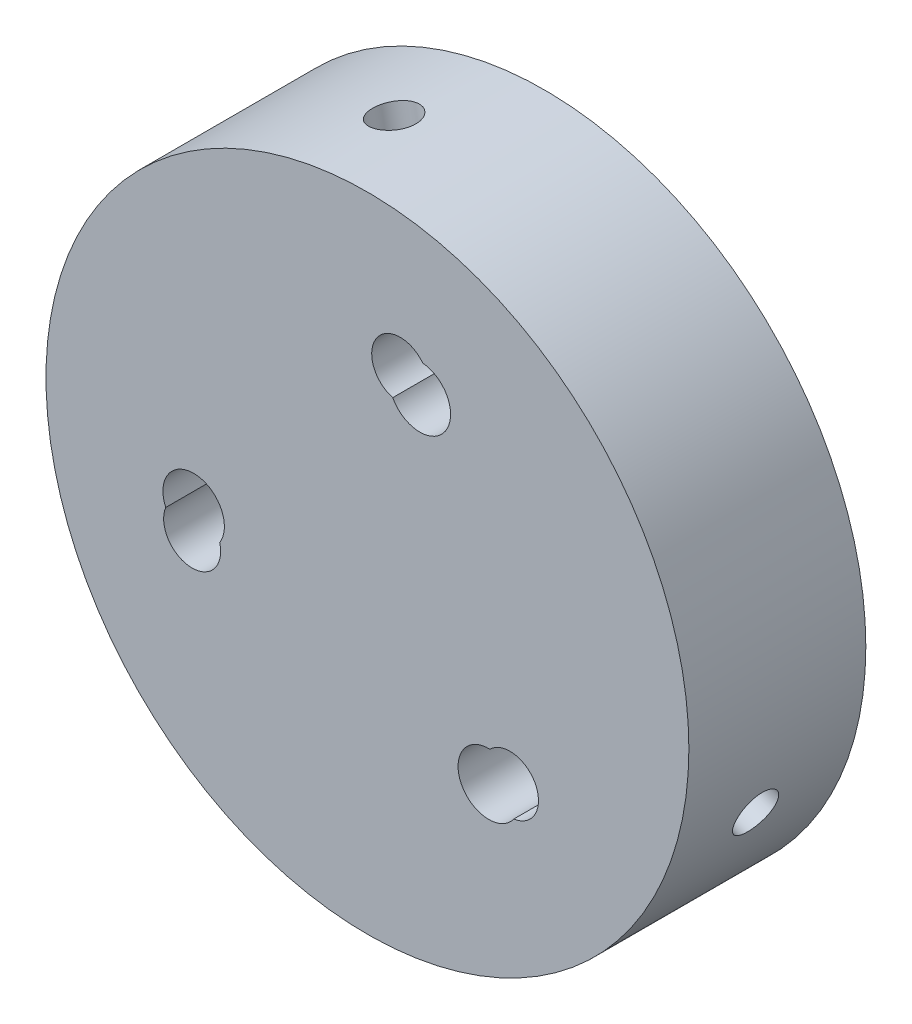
ISO-10303-21;
HEADER;
FILE_DESCRIPTION(('STEP AP214'),'2;1');
FILE_NAME('part.step','',(''),(''),'','','');
FILE_SCHEMA(('AUTOMOTIVE_DESIGN { 1 0 10303 214 1 1 1 1 }'));
ENDSEC;
DATA;
#1=APPLICATION_CONTEXT('core data for automotive mechanical design processes');
#2=APPLICATION_PROTOCOL_DEFINITION('international standard','automotive_design',2000,#1);
#3=PRODUCT_CONTEXT('',#1,'mechanical');
#4=PRODUCT('Part','Part','',(#3));
#5=PRODUCT_RELATED_PRODUCT_CATEGORY('part','',(#4));
#6=PRODUCT_DEFINITION_FORMATION('','',#4);
#7=PRODUCT_DEFINITION_CONTEXT('part definition',#1,'design');
#8=PRODUCT_DEFINITION('design','',#6,#7);
#9=PRODUCT_DEFINITION_SHAPE('','',#8);
#10=(LENGTH_UNIT() NAMED_UNIT(*) SI_UNIT(.MILLI.,.METRE.));
#11=(NAMED_UNIT(*) PLANE_ANGLE_UNIT() SI_UNIT($,.RADIAN.));
#12=(NAMED_UNIT(*) SI_UNIT($,.STERADIAN.) SOLID_ANGLE_UNIT());
#13=UNCERTAINTY_MEASURE_WITH_UNIT(LENGTH_MEASURE(1.E-05),#10,'distance_accuracy_value','');
#14=(GEOMETRIC_REPRESENTATION_CONTEXT(3) GLOBAL_UNCERTAINTY_ASSIGNED_CONTEXT((#13)) GLOBAL_UNIT_ASSIGNED_CONTEXT((#10,
#11,#12)) REPRESENTATION_CONTEXT('',''));
#15=CARTESIAN_POINT('',(0.,0.,0.));
#16=DIRECTION('',(0.,0.,1.));
#17=DIRECTION('',(1.,0.,0.));
#18=AXIS2_PLACEMENT_3D('',#15,#16,#17);
#19=CARTESIAN_POINT('',(-6.79339249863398,-2.45680522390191,0.));
#20=DIRECTION('',(0.,0.,1.));
#21=DIRECTION('',(1.,0.,0.));
#22=AXIS2_PLACEMENT_3D('',#19,#20,#21);
#23=CYLINDRICAL_SURFACE('',#22,0.5969);
#24=CARTESIAN_POINT('',(-6.79339249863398,-2.45680522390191,0.555167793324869));
#25=DIRECTION('',(0.,0.,1.));
#26=DIRECTION('',(1.,0.,0.));
#27=AXIS2_PLACEMENT_3D('',#24,#25,#26);
#28=CIRCLE('',#27,0.5969);
#29=CARTESIAN_POINT('',(-6.19649249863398,-2.45680522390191,0.555167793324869));
#30=VERTEX_POINT('',#29);
#31=EDGE_CURVE('E282',#30,#30,#28,.F.);
#32=ORIENTED_EDGE('',*,*,#31,.T.);
#33=EDGE_LOOP('',(#32));
#34=FACE_BOUND('',#33,.T.);
#35=CARTESIAN_POINT('',(-6.79339249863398,-2.45680522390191,1.778));
#36=DIRECTION('',(0.,0.,1.));
#37=DIRECTION('',(1.,0.,0.));
#38=AXIS2_PLACEMENT_3D('',#35,#36,#37);
#39=CIRCLE('',#38,0.5969);
#40=CARTESIAN_POINT('',(-6.19649249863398,-2.45680522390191,1.778));
#41=VERTEX_POINT('',#40);
#42=EDGE_CURVE('E117',#41,#41,#39,.F.);
#43=ORIENTED_EDGE('',*,*,#42,.F.);
#44=EDGE_LOOP('',(#43));
#45=FACE_BOUND('',#44,.T.);
#46=ADVANCED_FACE('F46',(#34,#45),#23,.F.);
#47=CARTESIAN_POINT('',(5.52513215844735,-4.6555053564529,0.));
#48=DIRECTION('',(0.,0.,1.));
#49=DIRECTION('',(1.,0.,0.));
#50=AXIS2_PLACEMENT_3D('',#47,#48,#49);
#51=CYLINDRICAL_SURFACE('',#50,0.5969);
#52=CARTESIAN_POINT('',(5.52513215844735,-4.6555053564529,0.555167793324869));
#53=DIRECTION('',(0.,0.,1.));
#54=DIRECTION('',(1.,0.,0.));
#55=AXIS2_PLACEMENT_3D('',#52,#53,#54);
#56=CIRCLE('',#55,0.5969);
#57=CARTESIAN_POINT('',(6.12203215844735,-4.6555053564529,0.555167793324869));
#58=VERTEX_POINT('',#57);
#59=EDGE_CURVE('E279',#58,#58,#56,.F.);
#60=ORIENTED_EDGE('',*,*,#59,.T.);
#61=EDGE_LOOP('',(#60));
#62=FACE_BOUND('',#61,.T.);
#63=CARTESIAN_POINT('',(5.52513215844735,-4.6555053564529,1.778));
#64=DIRECTION('',(0.,0.,1.));
#65=DIRECTION('',(1.,0.,0.));
#66=AXIS2_PLACEMENT_3D('',#63,#64,#65);
#67=CIRCLE('',#66,0.5969);
#68=CARTESIAN_POINT('',(6.12203215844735,-4.6555053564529,1.778));
#69=VERTEX_POINT('',#68);
#70=EDGE_CURVE('E129',#69,#69,#67,.F.);
#71=ORIENTED_EDGE('',*,*,#70,.F.);
#72=EDGE_LOOP('',(#71));
#73=FACE_BOUND('',#72,.T.);
#74=ADVANCED_FACE('F213',(#62,#73),#51,.F.);
#75=CARTESIAN_POINT('',(1.27,7.112,0.));
#76=DIRECTION('',(0.,0.,1.));
#77=DIRECTION('',(1.,0.,0.));
#78=AXIS2_PLACEMENT_3D('',#75,#76,#77);
#79=CYLINDRICAL_SURFACE('',#78,0.5969);
#80=CARTESIAN_POINT('',(1.27,7.112,0.555167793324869));
#81=DIRECTION('',(0.,0.,1.));
#82=DIRECTION('',(1.,0.,0.));
#83=AXIS2_PLACEMENT_3D('',#80,#81,#82);
#84=CIRCLE('',#83,0.5969);
#85=CARTESIAN_POINT('',(1.8669,7.112,0.555167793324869));
#86=VERTEX_POINT('',#85);
#87=EDGE_CURVE('E276',#86,#86,#84,.F.);
#88=ORIENTED_EDGE('',*,*,#87,.T.);
#89=EDGE_LOOP('',(#88));
#90=FACE_BOUND('',#89,.T.);
#91=CARTESIAN_POINT('',(1.27,7.112,1.778));
#92=DIRECTION('',(0.,0.,1.));
#93=DIRECTION('',(1.,0.,0.));
#94=AXIS2_PLACEMENT_3D('',#91,#92,#93);
#95=CIRCLE('',#94,0.5969);
#96=CARTESIAN_POINT('',(1.8669,7.112,1.778));
#97=VERTEX_POINT('',#96);
#98=EDGE_CURVE('E136',#97,#97,#95,.F.);
#99=ORIENTED_EDGE('',*,*,#98,.F.);
#100=EDGE_LOOP('',(#99));
#101=FACE_BOUND('',#100,.T.);
#102=ADVANCED_FACE('F217',(#90,#101),#79,.F.);
#103=CARTESIAN_POINT('',(0.,0.,6.858));
#104=DIRECTION('',(0.,0.,-1.));
#105=DIRECTION('',(-1.,0.,0.));
#106=AXIS2_PLACEMENT_3D('',#103,#104,#105);
#107=CYLINDRICAL_SURFACE('',#106,12.4587);
#108=CARTESIAN_POINT('',(-10.0041640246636,-7.42535573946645,3.556));
#109=CARTESIAN_POINT('',(-10.0041629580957,-7.42535758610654,3.50826441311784));
#110=CARTESIAN_POINT('',(-10.0017578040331,-7.42860103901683,3.46049563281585));
#111=CARTESIAN_POINT('',(-9.99218051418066,-7.44147809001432,3.36627775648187));
#112=CARTESIAN_POINT('',(-9.98500286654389,-7.45111907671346,3.31983025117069));
#113=CARTESIAN_POINT('',(-9.96603621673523,-7.47646821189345,3.22963327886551));
#114=CARTESIAN_POINT('',(-9.95424969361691,-7.49217309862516,3.18588237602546));
#115=CARTESIAN_POINT('',(-9.92632477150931,-7.52913116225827,3.10230215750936));
#116=CARTESIAN_POINT('',(-9.91018735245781,-7.55038308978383,3.06247196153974));
#117=CARTESIAN_POINT('',(-9.87388953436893,-7.59778922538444,2.98778216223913));
#118=CARTESIAN_POINT('',(-9.85372288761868,-7.6239510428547,2.95293042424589));
#119=CARTESIAN_POINT('',(-9.80984489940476,-7.68032694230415,2.88925424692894));
#120=CARTESIAN_POINT('',(-9.78613340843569,-7.71054119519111,2.86043006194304));
#121=CARTESIAN_POINT('',(-9.73570874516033,-7.77411255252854,2.80960244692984));
#122=CARTESIAN_POINT('',(-9.70899270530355,-7.807472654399,2.78760560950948));
#123=CARTESIAN_POINT('',(-9.65324804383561,-7.87629143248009,2.75109929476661));
#124=CARTESIAN_POINT('',(-9.62421945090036,-7.91175008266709,2.73658972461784));
#125=CARTESIAN_POINT('',(-9.56466116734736,-7.98364810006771,2.71549187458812));
#126=CARTESIAN_POINT('',(-9.53413391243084,-8.02008583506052,2.70889115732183));
#127=CARTESIAN_POINT('',(-9.47237643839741,-8.09293334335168,2.70375996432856));
#128=CARTESIAN_POINT('',(-9.44114622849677,-8.12934311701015,2.70522938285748));
#129=CARTESIAN_POINT('',(-9.37893108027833,-8.20104306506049,2.71618651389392));
#130=CARTESIAN_POINT('',(-9.34794581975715,-8.23633500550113,2.72566084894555));
#131=CARTESIAN_POINT('',(-9.28708659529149,-8.30489800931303,2.75233810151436));
#132=CARTESIAN_POINT('',(-9.25721263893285,-8.33816905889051,2.76954107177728));
#133=CARTESIAN_POINT('',(-9.19946598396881,-8.40183801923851,2.81120235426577));
#134=CARTESIAN_POINT('',(-9.17159497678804,-8.43223350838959,2.8356667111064));
#135=CARTESIAN_POINT('',(-9.11875915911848,-8.48934349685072,2.89115191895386));
#136=CARTESIAN_POINT('',(-9.09379438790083,-8.51605794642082,2.922172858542));
#137=CARTESIAN_POINT('',(-9.04753047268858,-8.56519362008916,2.98996617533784));
#138=CARTESIAN_POINT('',(-9.02623891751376,-8.5876059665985,3.02675016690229));
#139=CARTESIAN_POINT('',(-8.98809171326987,-8.62752443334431,3.1049847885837));
#140=CARTESIAN_POINT('',(-8.97123606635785,-8.64503055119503,3.1464354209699));
#141=CARTESIAN_POINT('',(-8.9425327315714,-8.67471858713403,3.23283431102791));
#142=CARTESIAN_POINT('',(-8.93068540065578,-8.68690012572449,3.27778281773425));
#143=CARTESIAN_POINT('',(-8.91241140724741,-8.70564767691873,3.36989800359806));
#144=CARTESIAN_POINT('',(-8.90598466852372,-8.71221376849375,3.41706465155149));
#145=CARTESIAN_POINT('',(-8.89878468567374,-8.71956786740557,3.51217527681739));
#146=CARTESIAN_POINT('',(-8.89800005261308,-8.72036751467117,3.56011749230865));
#147=CARTESIAN_POINT('',(-8.90208173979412,-8.71620069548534,3.65550796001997));
#148=CARTESIAN_POINT('',(-8.90694802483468,-8.71123426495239,3.70295621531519));
#149=CARTESIAN_POINT('',(-8.92215343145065,-8.69565988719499,3.79596576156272));
#150=CARTESIAN_POINT('',(-8.93248731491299,-8.68505733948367,3.84152881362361));
#151=CARTESIAN_POINT('',(-8.95826701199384,-8.65846399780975,3.92952899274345));
#152=CARTESIAN_POINT('',(-8.973712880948,-8.64247314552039,3.97196608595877));
#153=CARTESIAN_POINT('',(-9.0092198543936,-8.60545290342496,4.05258427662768));
#154=CARTESIAN_POINT('',(-9.02928830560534,-8.58441549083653,4.09075845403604));
#155=CARTESIAN_POINT('',(-9.07335712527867,-8.53782300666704,4.16169742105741));
#156=CARTESIAN_POINT('',(-9.09735753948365,-8.51226788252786,4.19446214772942));
#157=CARTESIAN_POINT('',(-9.14855094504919,-8.45722375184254,4.25370716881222));
#158=CARTESIAN_POINT('',(-9.17574917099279,-8.42772828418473,4.280176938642));
#159=CARTESIAN_POINT('',(-9.23243889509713,-8.36558690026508,4.32600860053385));
#160=CARTESIAN_POINT('',(-9.26193037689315,-8.33294100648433,4.34537054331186));
#161=CARTESIAN_POINT('',(-9.32226528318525,-8.26538705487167,4.37641868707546));
#162=CARTESIAN_POINT('',(-9.35310751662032,-8.23048097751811,4.38811151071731));
#163=CARTESIAN_POINT('',(-9.41523991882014,-8.15933162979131,4.40351116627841));
#164=CARTESIAN_POINT('',(-9.44653008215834,-8.12308837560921,4.40721809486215));
#165=CARTESIAN_POINT('',(-9.50858621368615,-8.05035865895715,4.40653975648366));
#166=CARTESIAN_POINT('',(-9.53935311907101,-8.01387284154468,4.40217094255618));
#167=CARTESIAN_POINT('',(-9.59957344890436,-7.94163757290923,4.38549929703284));
#168=CARTESIAN_POINT('',(-9.62902687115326,-7.90588812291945,4.373196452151));
#169=CARTESIAN_POINT('',(-9.68583792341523,-7.83618355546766,4.34100982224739));
#170=CARTESIAN_POINT('',(-9.71319558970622,-7.80222840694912,4.3211261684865));
#171=CARTESIAN_POINT('',(-9.76512342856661,-7.73713808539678,4.2743444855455));
#172=CARTESIAN_POINT('',(-9.78969366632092,-7.70600284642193,4.24744662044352));
#173=CARTESIAN_POINT('',(-9.83549898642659,-7.64745396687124,4.18733883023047));
#174=CARTESIAN_POINT('',(-9.85672758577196,-7.62004757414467,4.1541169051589));
#175=CARTESIAN_POINT('',(-9.89530465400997,-7.569884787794,4.08232218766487));
#176=CARTESIAN_POINT('',(-9.91265217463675,-7.54712953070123,4.04374809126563));
#177=CARTESIAN_POINT('',(-9.9430917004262,-7.50698146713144,3.96229236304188));
#178=CARTESIAN_POINT('',(-9.95617773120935,-7.48959619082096,3.91940479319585));
#179=CARTESIAN_POINT('',(-9.97776185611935,-7.46081769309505,3.83061338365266));
#180=CARTESIAN_POINT('',(-9.9862652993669,-7.44941748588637,3.78471313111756));
#181=CARTESIAN_POINT('',(-9.99630587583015,-7.4359340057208,3.70811207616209));
#182=CARTESIAN_POINT('',(-9.99924966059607,-7.43197301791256,3.67790584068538));
#183=CARTESIAN_POINT('',(-10.0031790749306,-7.42668329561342,3.61713760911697));
#184=CARTESIAN_POINT('',(-10.004164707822,-7.42535455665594,3.58657561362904));
#185=CARTESIAN_POINT('',(-10.0041640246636,-7.42535573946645,3.556));
#186=B_SPLINE_CURVE_WITH_KNOTS('',3,(#108,#109,#110,#111,#112,#113,#114,#115,#116,#117,#118,
#119,#120,#121,#122,#123,#124,#125,#126,#127,#128,#129,#130,#131,#132,#133,#134,#135,#136,#137,
#138,#139,#140,#141,#142,#143,#144,#145,#146,#147,#148,#149,#150,#151,#152,#153,#154,#155,#156,
#157,#158,#159,#160,#161,#162,#163,#164,#165,#166,#167,#168,#169,#170,#171,#172,#173,#174,#175,
#176,#177,#178,#179,#180,#181,#182,#183,#184,#185),.UNSPECIFIED.,.T.,.F.,(4,2,2,2,2,2,2,2,2,2,2,
2,2,2,2,2,2,2,2,2,2,2,2,2,2,2,2,2,2,2,2,2,2,2,2,2,2,2,4),(0.,0.14309513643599,0.286355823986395,
0.429539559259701,0.572691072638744,0.716066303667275,0.859447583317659,1.00296688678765,
1.14648441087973,1.28977594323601,1.433065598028,1.57611626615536,1.71916791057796,
1.862338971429,2.00551196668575,2.14897730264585,2.29244270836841,2.43591833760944,
2.57939194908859,2.7225758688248,2.86575889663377,3.00880499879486,3.15185264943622,
3.29512923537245,3.43840748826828,3.58192363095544,3.72543874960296,3.86882977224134,
4.01221905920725,4.15531653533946,4.2984142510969,4.44150948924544,4.58460138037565,
4.72796754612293,4.87136870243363,5.0149700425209,5.15840339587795,5.25005889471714,
5.34171423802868),.UNSPECIFIED.);
#187=CARTESIAN_POINT('',(-10.0041640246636,-7.42535573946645,3.556));
#188=VERTEX_POINT('',#187);
#189=EDGE_CURVE('E144',#188,#188,#186,.T.);
#190=ORIENTED_EDGE('',*,*,#189,.F.);
#191=EDGE_LOOP('',(#190));
#192=FACE_BOUND('',#191,.T.);
#193=CARTESIAN_POINT('',(0.,0.,0.));
#194=DIRECTION('',(0.,0.,1.));
#195=DIRECTION('',(1.,0.,0.));
#196=AXIS2_PLACEMENT_3D('',#193,#194,#195);
#197=CIRCLE('',#196,12.4587);
#198=CARTESIAN_POINT('',(12.4587,0.,0.));
#199=VERTEX_POINT('',#198);
#200=EDGE_CURVE('E263',#199,#199,#197,.T.);
#201=ORIENTED_EDGE('',*,*,#200,.T.);
#202=EDGE_LOOP('',(#201));
#203=FACE_BOUND('',#202,.T.);
#204=CARTESIAN_POINT('',(0.,0.,6.858));
#205=DIRECTION('',(0.,0.,1.));
#206=DIRECTION('',(1.,0.,0.));
#207=AXIS2_PLACEMENT_3D('',#204,#205,#206);
#208=CIRCLE('',#207,12.4587);
#209=CARTESIAN_POINT('',(12.4587,0.,6.858));
#210=VERTEX_POINT('',#209);
#211=EDGE_CURVE('E266',#210,#210,#208,.T.);
#212=ORIENTED_EDGE('',*,*,#211,.F.);
#213=EDGE_LOOP('',(#212));
#214=FACE_BOUND('',#213,.T.);
#215=CARTESIAN_POINT('',(-1.42846469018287,12.3765380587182,3.556));
#216=CARTESIAN_POINT('',(-1.42846682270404,12.3765380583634,3.50826441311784));
#217=CARTESIAN_POINT('',(-1.4324783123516,12.3760768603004,3.46049563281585));
#218=CARTESIAN_POINT('',(-1.44841881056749,12.3742212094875,3.36627775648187));
#219=CARTESIAN_POINT('',(-1.46035697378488,12.3728256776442,3.31983025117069));
#220=CARTESIAN_POINT('',(-1.49179329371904,12.3690746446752,3.22963327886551));
#221=CARTESIAN_POINT('',(-1.51128738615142,12.3667196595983,3.18588237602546));
#222=CARTESIAN_POINT('',(-1.55725646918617,12.3610149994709,3.10230215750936));
#223=CARTESIAN_POINT('',(-1.58372988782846,12.3576655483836,3.06247196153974));
#224=CARTESIAN_POINT('',(-1.64293371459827,12.349933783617,2.98778216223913));
#225=CARTESIAN_POINT('',(-1.6756738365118,12.3455498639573,2.95293042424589));
#226=CARTESIAN_POINT('',(-1.74643579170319,12.3357383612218,2.88925424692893));
#227=CARTESIAN_POINT('',(-1.7844578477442,12.3303107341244,2.86043006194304));
#228=CARTESIAN_POINT('',(-1.86472458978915,12.3184273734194,2.80960244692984));
#229=CARTESIAN_POINT('',(-1.9069733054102,12.3119706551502,2.78760560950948));
#230=CARTESIAN_POINT('',(-1.9944444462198,12.2981037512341,2.75109929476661));
#231=CARTESIAN_POINT('',(-2.03966683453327,12.2906935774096,2.73658972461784));
#232=CARTESIAN_POINT('',(-2.13171148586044,12.2750635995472,2.71549187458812));
#233=CARTESIAN_POINT('',(-2.17853111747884,12.2668450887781,2.70889115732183));
#234=CARTESIAN_POINT('',(-2.2724976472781,12.2497853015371,2.70375996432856));
#235=CARTESIAN_POINT('',(-2.3196445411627,12.2409440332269,2.70522938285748));
#236=CARTESIAN_POINT('',(-2.41284609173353,12.2229141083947,2.71618651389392));
#237=CARTESIAN_POINT('',(-2.45890243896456,12.2137260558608,2.72566084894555));
#238=CARTESIAN_POINT('',(-2.54870935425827,12.1953019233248,2.75233810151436));
#239=CARTESIAN_POINT('',(-2.59245990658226,12.1860658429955,2.76954107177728));
#240=CARTESIAN_POINT('',(-2.67647217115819,12.167890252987,2.81120235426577));
#241=CARTESIAN_POINT('',(-2.71673094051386,12.158950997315,2.8356667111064));
#242=CARTESIAN_POINT('',(-2.79260755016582,12.141748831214,2.89115191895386));
#243=CARTESIAN_POINT('',(-2.82822532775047,12.1334859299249,2.922172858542));
#244=CARTESIAN_POINT('',(-2.89391002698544,12.1179880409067,2.98996617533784));
#245=CARTESIAN_POINT('',(-2.92396546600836,12.1107551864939,3.02675016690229));
#246=CARTESIAN_POINT('',(-2.97760947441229,12.0976779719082,3.1049847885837));
#247=CARTESIAN_POINT('',(-3.00119804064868,12.0918336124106,3.1464354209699));
#248=CARTESIAN_POINT('',(-3.04126030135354,12.0818198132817,3.23283431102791));
#249=CARTESIAN_POINT('',(-3.05773348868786,12.0776504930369,3.27778281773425));
#250=CARTESIAN_POINT('',(-3.08310634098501,12.0711985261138,3.36989800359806));
#251=CARTESIAN_POINT('',(-3.0920061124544,12.0689158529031,3.41706465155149));
#252=CARTESIAN_POINT('',(-3.10197494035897,12.0663575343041,3.51217527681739));
#253=CARTESIAN_POINT('',(-3.10305977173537,12.0660778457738,3.56011749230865));
#254=CARTESIAN_POINT('',(-3.09741035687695,12.0675292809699,3.65550796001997));
#255=CARTESIAN_POINT('',(-3.090676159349,12.0692603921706,3.70295621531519));
#256=CARTESIAN_POINT('',(-3.06958564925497,12.0746414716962,3.79596576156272));
#257=CARTESIAN_POINT('',(-3.05523663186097,12.0782896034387,3.84152881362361));
#258=CARTESIAN_POINT('',(-3.01931627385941,12.0873188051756,3.92952899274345));
#259=CARTESIAN_POINT('',(-2.99774485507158,12.0926998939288,3.97196608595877));
#260=CARTESIAN_POINT('',(-2.94793089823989,12.1049397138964,4.05258427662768));
#261=CARTESIAN_POINT('',(-2.91967773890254,12.1118007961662,4.09075845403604));
#262=CARTESIAN_POINT('',(-2.85729305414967,12.1266692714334,4.16169742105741));
#263=CARTESIAN_POINT('',(-2.82316146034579,12.1346766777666,4.19446214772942));
#264=CARTESIAN_POINT('',(-2.7498951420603,12.15148940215,4.25370716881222));
#265=CARTESIAN_POINT('',(-2.71075220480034,12.1602960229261,4.280176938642));
#266=CARTESIAN_POINT('',(-2.62859132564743,12.1783200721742,4.32600860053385));
#267=CARTESIAN_POINT('',(-2.58557341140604,12.1875374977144,4.34537054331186));
#268=CARTESIAN_POINT('',(-2.4969025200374,12.206012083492,4.37641868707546));
#269=CARTESIAN_POINT('',(-2.45125185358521,12.2152692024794,4.38811151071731));
#270=CARTESIAN_POINT('',(-2.35856850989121,12.2335027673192,4.40351116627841));
#271=CARTESIAN_POINT('',(-2.31153584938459,12.2424792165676,4.40721809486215));
#272=CARTESIAN_POINT('',(-2.21752200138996,12.2598565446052,4.40653975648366));
#273=CARTESIAN_POINT('',(-2.17054090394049,12.2682585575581,4.40217094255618));
#274=CARTESIAN_POINT('',(-2.07787316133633,12.2842932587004,4.38549929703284));
#275=CARTESIAN_POINT('',(-2.0321865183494,12.2919259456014,4.373196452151));
#276=CARTESIAN_POINT('',(-1.94341506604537,12.3062734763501,4.34100982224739));
#277=CARTESIAN_POINT('',(-1.90033021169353,12.3129883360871,4.3211261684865));
#278=CARTESIAN_POINT('',(-1.81799642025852,12.3254140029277,4.2743444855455));
#279=CARTESIAN_POINT('',(-1.77874739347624,12.3311248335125,4.24744662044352));
#280=CARTESIAN_POINT('',(-1.70513991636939,12.3415189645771,4.18733883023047));
#281=CARTESIAN_POINT('',(-1.67079098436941,12.3462002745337,4.1541169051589));
#282=CARTESIAN_POINT('',(-1.60806020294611,12.354527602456,4.08232218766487));
#283=CARTESIAN_POINT('',(-1.57967981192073,12.3581733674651,4.04374809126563));
#284=CARTESIAN_POINT('',(-1.52969080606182,12.364460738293,3.96229236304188));
#285=CARTESIAN_POINT('',(-1.50809169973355,12.3671009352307,3.91940479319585));
#286=CARTESIAN_POINT('',(-1.47237672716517,12.3714040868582,3.83061338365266));
#287=CARTESIAN_POINT('',(-1.45825213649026,12.3730681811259,3.78471313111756));
#288=CARTESIAN_POINT('',(-1.44155481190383,12.375021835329,3.70811207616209));
#289=CARTESIAN_POINT('',(-1.43665260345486,12.3755907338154,3.67790584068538));
#290=CARTESIAN_POINT('',(-1.43010686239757,12.3763488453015,3.61713760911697));
#291=CARTESIAN_POINT('',(-1.42846332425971,12.3765380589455,3.58657561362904));
#292=CARTESIAN_POINT('',(-1.42846469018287,12.3765380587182,3.556));
#293=B_SPLINE_CURVE_WITH_KNOTS('',3,(#215,#216,#217,#218,#219,#220,#221,#222,#223,#224,#225,
#226,#227,#228,#229,#230,#231,#232,#233,#234,#235,#236,#237,#238,#239,#240,#241,#242,#243,#244,
#245,#246,#247,#248,#249,#250,#251,#252,#253,#254,#255,#256,#257,#258,#259,#260,#261,#262,#263,
#264,#265,#266,#267,#268,#269,#270,#271,#272,#273,#274,#275,#276,#277,#278,#279,#280,#281,#282,
#283,#284,#285,#286,#287,#288,#289,#290,#291,#292),.UNSPECIFIED.,.T.,.F.,(4,2,2,2,2,2,2,2,2,2,2,
2,2,2,2,2,2,2,2,2,2,2,2,2,2,2,2,2,2,2,2,2,2,2,2,2,2,2,4),(0.,0.14309513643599,0.286355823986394,
0.4295395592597,0.572691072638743,0.716066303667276,0.859447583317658,1.00296688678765,
1.14648441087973,1.28977594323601,1.433065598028,1.57611626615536,1.71916791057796,
1.862338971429,2.00551196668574,2.14897730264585,2.29244270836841,2.43591833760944,
2.57939194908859,2.7225758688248,2.86575889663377,3.00880499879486,3.15185264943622,
3.29512923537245,3.43840748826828,3.58192363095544,3.72543874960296,3.86882977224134,
4.01221905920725,4.15531653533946,4.2984142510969,4.44150948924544,4.58460138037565,
4.72796754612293,4.87136870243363,5.0149700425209,5.15840339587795,5.25005889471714,
5.34171423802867),.UNSPECIFIED.);
#294=CARTESIAN_POINT('',(-1.42846469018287,12.3765380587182,3.556));
#295=VERTEX_POINT('',#294);
#296=EDGE_CURVE('E308',#295,#295,#293,.T.);
#297=ORIENTED_EDGE('',*,*,#296,.F.);
#298=EDGE_LOOP('',(#297));
#299=FACE_BOUND('',#298,.T.);
#300=CARTESIAN_POINT('',(11.4326287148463,-4.95118231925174,3.556));
#301=CARTESIAN_POINT('',(11.4326297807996,-4.95118047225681,3.50826441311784));
#302=CARTESIAN_POINT('',(11.4342361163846,-4.94747582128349,3.46049563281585));
#303=CARTESIAN_POINT('',(11.4405993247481,-4.93274311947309,3.36627775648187));
#304=CARTESIAN_POINT('',(11.4453598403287,-4.92170660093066,3.31983025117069));
#305=CARTESIAN_POINT('',(11.4578295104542,-4.89260643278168,3.22963327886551));
#306=CARTESIAN_POINT('',(11.4655370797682,-4.87454656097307,3.18588237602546));
#307=CARTESIAN_POINT('',(11.4835812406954,-4.83188383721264,3.10230215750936));
#308=CARTESIAN_POINT('',(11.4939172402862,-4.80728245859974,3.06247196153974));
#309=CARTESIAN_POINT('',(11.5168232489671,-4.75214455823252,2.98778216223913));
#310=CARTESIAN_POINT('',(11.5293967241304,-4.72159882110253,2.95293042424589));
#311=CARTESIAN_POINT('',(11.5562806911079,-4.6554114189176,2.88925424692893));
#312=CARTESIAN_POINT('',(11.5705912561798,-4.61976953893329,2.86043006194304));
#313=CARTESIAN_POINT('',(11.6004333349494,-4.54431482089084,2.80960244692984));
#314=CARTESIAN_POINT('',(11.6159660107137,-4.50449800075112,2.78760560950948));
#315=CARTESIAN_POINT('',(11.6476924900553,-4.42181231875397,2.75109929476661));
#316=CARTESIAN_POINT('',(11.6638862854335,-4.37894349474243,2.73658972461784));
#317=CARTESIAN_POINT('',(11.6963726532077,-4.29141549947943,2.71549187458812));
#318=CARTESIAN_POINT('',(11.7126650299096,-4.24675925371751,2.70889115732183));
#319=CARTESIAN_POINT('',(11.7448740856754,-4.15685195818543,2.70375996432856));
#320=CARTESIAN_POINT('',(11.7607907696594,-4.11160091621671,2.70522938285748));
#321=CARTESIAN_POINT('',(11.7917771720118,-4.02187104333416,2.71618651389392));
#322=CARTESIAN_POINT('',(11.8068482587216,-3.97739105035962,2.72566084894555));
#323=CARTESIAN_POINT('',(11.8357959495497,-3.89040391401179,2.75233810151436));
#324=CARTESIAN_POINT('',(11.849672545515,-3.84789678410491,2.76954107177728));
#325=CARTESIAN_POINT('',(11.8759381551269,-3.76605223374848,2.81120235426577));
#326=CARTESIAN_POINT('',(11.8883259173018,-3.72671748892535,2.8356667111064));
#327=CARTESIAN_POINT('',(11.9113667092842,-3.65240533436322,2.89115191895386));
#328=CARTESIAN_POINT('',(11.9220197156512,-3.61742798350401,2.922172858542));
#329=CARTESIAN_POINT('',(11.9414404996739,-3.5527944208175,2.98996617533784));
#330=CARTESIAN_POINT('',(11.950204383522,-3.52314921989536,3.02675016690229));
#331=CARTESIAN_POINT('',(11.9657011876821,-3.4701535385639,3.1049847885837));
#332=CARTESIAN_POINT('',(11.9724341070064,-3.4468030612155,3.1464354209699));
#333=CARTESIAN_POINT('',(11.9837930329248,-3.4071012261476,3.23283431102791));
#334=CARTESIAN_POINT('',(11.9884188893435,-3.39075036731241,3.27778281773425));
#335=CARTESIAN_POINT('',(11.9955177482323,-3.36555084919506,3.36989800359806));
#336=CARTESIAN_POINT('',(11.997990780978,-3.35670208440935,3.41706465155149));
#337=CARTESIAN_POINT('',(12.0007596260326,-3.34678966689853,3.51217527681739));
#338=CARTESIAN_POINT('',(12.0010598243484,-3.34571033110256,3.56011749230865));
#339=CARTESIAN_POINT('',(11.999492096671,-3.35132858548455,3.65550796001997));
#340=CARTESIAN_POINT('',(11.9976241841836,-3.35802612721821,3.70295621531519));
#341=CARTESIAN_POINT('',(11.9917390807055,-3.37898158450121,3.79596576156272));
#342=CARTESIAN_POINT('',(11.9877239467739,-3.39323226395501,3.84152881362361));
#343=CARTESIAN_POINT('',(11.9775832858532,-3.42885480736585,3.92952899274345));
#344=CARTESIAN_POINT('',(11.9714577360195,-3.45022674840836,3.97196608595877));
#345=CARTESIAN_POINT('',(11.9571507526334,-3.49948681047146,4.05258427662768));
#346=CARTESIAN_POINT('',(11.9489660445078,-3.52738530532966,4.09075845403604));
#347=CARTESIAN_POINT('',(11.9306501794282,-3.5888462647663,4.16169742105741));
#348=CARTESIAN_POINT('',(11.9205189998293,-3.62240879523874,4.19446214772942));
#349=CARTESIAN_POINT('',(11.8984460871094,-3.6942656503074,4.25370716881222));
#350=CARTESIAN_POINT('',(11.886501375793,-3.73256773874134,4.280176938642));
#351=CARTESIAN_POINT('',(11.8610302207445,-3.81273317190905,4.32600860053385));
#352=CARTESIAN_POINT('',(11.8475037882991,-3.85459649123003,4.34537054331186));
#353=CARTESIAN_POINT('',(11.8191678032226,-3.94062502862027,4.37641868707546));
#354=CARTESIAN_POINT('',(11.8043593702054,-3.98478822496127,4.38811151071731));
#355=CARTESIAN_POINT('',(11.7738084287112,-4.07417113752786,4.40351116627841));
#356=CARTESIAN_POINT('',(11.7580659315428,-4.11939084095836,4.40721809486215));
#357=CARTESIAN_POINT('',(11.726108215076,-4.20949788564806,4.40653975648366));
#358=CARTESIAN_POINT('',(11.7098940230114,-4.25438571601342,4.40217094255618));
#359=CARTESIAN_POINT('',(11.6774466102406,-4.3426556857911,4.38549929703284));
#360=CARTESIAN_POINT('',(11.6612133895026,-4.38603782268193,4.373196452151));
#361=CARTESIAN_POINT('',(11.6292529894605,-4.47008992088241,4.34100982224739));
#362=CARTESIAN_POINT('',(11.6135258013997,-4.51075992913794,4.3211261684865));
#363=CARTESIAN_POINT('',(11.583119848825,-4.58827591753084,4.2743444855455));
#364=CARTESIAN_POINT('',(11.5684410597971,-4.62512198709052,4.24744662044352));
#365=CARTESIAN_POINT('',(11.5406389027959,-4.69406499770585,4.18733883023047));
#366=CARTESIAN_POINT('',(11.5275185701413,-4.72615270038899,4.1541169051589));
#367=CARTESIAN_POINT('',(11.503364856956,-4.78464281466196,4.08232218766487));
#368=CARTESIAN_POINT('',(11.4923319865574,-4.81104383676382,4.04374809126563));
#369=CARTESIAN_POINT('',(11.4727825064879,-4.85747927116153,3.96229236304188));
#370=CARTESIAN_POINT('',(11.4642694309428,-4.87750474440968,3.91940479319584));
#371=CARTESIAN_POINT('',(11.4501385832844,-4.91058639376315,3.83061338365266));
#372=CARTESIAN_POINT('',(11.4445174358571,-4.92365069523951,3.78471313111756));
#373=CARTESIAN_POINT('',(11.4378606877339,-4.93908782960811,3.70811207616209));
#374=CARTESIAN_POINT('',(11.4359022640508,-4.94361771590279,3.67790584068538));
#375=CARTESIAN_POINT('',(11.4332859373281,-4.94966554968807,3.61713760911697));
#376=CARTESIAN_POINT('',(11.4326280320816,-4.95118350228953,3.58657561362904));
#377=CARTESIAN_POINT('',(11.4326287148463,-4.95118231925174,3.556));
#378=B_SPLINE_CURVE_WITH_KNOTS('',3,(#300,#301,#302,#303,#304,#305,#306,#307,#308,#309,#310,
#311,#312,#313,#314,#315,#316,#317,#318,#319,#320,#321,#322,#323,#324,#325,#326,#327,#328,#329,
#330,#331,#332,#333,#334,#335,#336,#337,#338,#339,#340,#341,#342,#343,#344,#345,#346,#347,#348,
#349,#350,#351,#352,#353,#354,#355,#356,#357,#358,#359,#360,#361,#362,#363,#364,#365,#366,#367,
#368,#369,#370,#371,#372,#373,#374,#375,#376,#377),.UNSPECIFIED.,.T.,.F.,(4,2,2,2,2,2,2,2,2,2,2,
2,2,2,2,2,2,2,2,2,2,2,2,2,2,2,2,2,2,2,2,2,2,2,2,2,2,2,4),(0.,0.14309513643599,0.286355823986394,
0.429539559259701,0.572691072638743,0.716066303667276,0.859447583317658,1.00296688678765,
1.14648441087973,1.28977594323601,1.433065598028,1.57611626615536,1.71916791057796,
1.862338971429,2.00551196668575,2.14897730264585,2.29244270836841,2.43591833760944,
2.57939194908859,2.7225758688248,2.86575889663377,3.00880499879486,3.15185264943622,
3.29512923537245,3.43840748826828,3.58192363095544,3.72543874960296,3.86882977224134,
4.01221905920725,4.15531653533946,4.2984142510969,4.44150948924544,4.58460138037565,
4.72796754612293,4.87136870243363,5.0149700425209,5.15840339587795,5.25005889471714,
5.34171423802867),.UNSPECIFIED.);
#379=CARTESIAN_POINT('',(11.4326287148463,-4.95118231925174,3.556));
#380=VERTEX_POINT('',#379);
#381=EDGE_CURVE('E365',#380,#380,#378,.T.);
#382=ORIENTED_EDGE('',*,*,#381,.F.);
#383=EDGE_LOOP('',(#382));
#384=FACE_BOUND('',#383,.T.);
#385=ADVANCED_FACE('F48',(#192,#203,#214,#299,#384),#107,.T.);
#386=CARTESIAN_POINT('',(0.,0.,4.826));
#387=DIRECTION('',(0.,0.,-1.));
#388=DIRECTION('',(-1.,0.,0.));
#389=AXIS2_PLACEMENT_3D('',#386,#387,#388);
#390=CYLINDRICAL_SURFACE('',#389,1.1811);
#391=CARTESIAN_POINT('',(-1.1811,0.,3.92430018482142));
#392=CARTESIAN_POINT('',(-1.18109767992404,-0.0293160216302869,3.97073408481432));
#393=CARTESIAN_POINT('',(-1.17999288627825,-0.062837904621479,4.01454395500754));
#394=CARTESIAN_POINT('',(-1.17382998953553,-0.135925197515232,4.09670226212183));
#395=CARTESIAN_POINT('',(-1.16875596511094,-0.175514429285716,4.13502796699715));
#396=CARTESIAN_POINT('',(-1.15313934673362,-0.258986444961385,4.20558564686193));
#397=CARTESIAN_POINT('',(-1.14258823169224,-0.302875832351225,4.23780801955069));
#398=CARTESIAN_POINT('',(-1.11475112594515,-0.393118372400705,4.29495036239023));
#399=CARTESIAN_POINT('',(-1.09748538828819,-0.4394637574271,4.31989190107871));
#400=CARTESIAN_POINT('',(-1.06079349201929,-0.520738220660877,4.3558634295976));
#401=CARTESIAN_POINT('',(-1.04303548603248,-0.555570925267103,4.36881844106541));
#402=CARTESIAN_POINT('',(-1.00331923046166,-0.62443806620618,4.38931193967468));
#403=CARTESIAN_POINT('',(-0.981363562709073,-0.658472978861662,4.3968537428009));
#404=CARTESIAN_POINT('',(-0.933525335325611,-0.724707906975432,4.40609863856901));
#405=CARTESIAN_POINT('',(-0.907629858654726,-0.756901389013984,4.40778207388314));
#406=CARTESIAN_POINT('',(-0.852733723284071,-0.818252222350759,4.40514529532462));
#407=CARTESIAN_POINT('',(-0.823732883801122,-0.847409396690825,4.40082473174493));
#408=CARTESIAN_POINT('',(-0.765243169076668,-0.90048880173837,4.3868323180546));
#409=CARTESIAN_POINT('',(-0.73585848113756,-0.924604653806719,4.37745106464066));
#410=CARTESIAN_POINT('',(-0.676170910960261,-0.96911175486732,4.3540065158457));
#411=CARTESIAN_POINT('',(-0.645867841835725,-0.989502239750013,4.33994226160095));
#412=CARTESIAN_POINT('',(-0.582563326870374,-1.02815861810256,4.30626483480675));
#413=CARTESIAN_POINT('',(-0.549556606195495,-1.04608507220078,4.28627521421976));
#414=CARTESIAN_POINT('',(-0.484423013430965,-1.07779698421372,4.24203602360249));
#415=CARTESIAN_POINT('',(-0.452296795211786,-1.09157943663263,4.21778338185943));
#416=CARTESIAN_POINT('',(-0.384090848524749,-1.11760164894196,4.16075679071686));
#417=CARTESIAN_POINT('',(-0.348354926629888,-1.12910478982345,4.12723527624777));
#418=CARTESIAN_POINT('',(-0.280715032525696,-1.14779218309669,4.05540768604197));
#419=CARTESIAN_POINT('',(-0.248813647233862,-1.15497353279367,4.01709841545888));
#420=CARTESIAN_POINT('',(-0.194685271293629,-1.16522346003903,3.9415508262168));
#421=CARTESIAN_POINT('',(-0.17173072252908,-1.16872289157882,3.90489451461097));
#422=CARTESIAN_POINT('',(-0.131645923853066,-1.17391481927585,3.82841623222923));
#423=CARTESIAN_POINT('',(-0.114503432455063,-1.17561112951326,3.78860113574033));
#424=CARTESIAN_POINT('',(-0.0906125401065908,-1.17766797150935,3.71465312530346));
#425=CARTESIAN_POINT('',(-0.0824689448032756,-1.17822819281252,3.68098242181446));
#426=CARTESIAN_POINT('',(-0.0719982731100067,-1.17891599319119,3.61275613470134));
#427=CARTESIAN_POINT('',(-0.0696637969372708,-1.17904412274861,3.5782017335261));
#428=CARTESIAN_POINT('',(-0.0710971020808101,-1.17895825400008,3.50919770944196));
#429=CARTESIAN_POINT('',(-0.0748695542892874,-1.1787439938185,3.47474818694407));
#430=CARTESIAN_POINT('',(-0.0880544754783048,-1.17783076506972,3.40693535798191));
#431=CARTESIAN_POINT('',(-0.097475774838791,-1.17713103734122,3.37357383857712));
#432=CARTESIAN_POINT('',(-0.124814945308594,-1.17458937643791,3.29814601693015));
#433=CARTESIAN_POINT('',(-0.144491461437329,-1.17245232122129,3.2567336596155));
#434=CARTESIAN_POINT('',(-0.189830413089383,-1.16596973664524,3.17753262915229));
#435=CARTESIAN_POINT('',(-0.215502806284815,-1.16162051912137,3.13975013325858));
#436=CARTESIAN_POINT('',(-0.271886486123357,-1.14975162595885,3.06698322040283));
#437=CARTESIAN_POINT('',(-0.302719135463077,-1.14214626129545,3.03210731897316));
#438=CARTESIAN_POINT('',(-0.367519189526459,-1.12297391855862,2.96659573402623));
#439=CARTESIAN_POINT('',(-0.401487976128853,-1.1114051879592,2.9359619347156));
#440=CARTESIAN_POINT('',(-0.478215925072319,-1.08089110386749,2.87388307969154));
#441=CARTESIAN_POINT('',(-0.521401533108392,-1.06094979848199,2.84343467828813));
#442=CARTESIAN_POINT('',(-0.608517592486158,-1.01348305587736,2.79056542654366));
#443=CARTESIAN_POINT('',(-0.652446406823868,-0.985972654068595,2.76812886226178));
#444=CARTESIAN_POINT('',(-0.726323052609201,-0.932153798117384,2.7378624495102));
#445=CARTESIAN_POINT('',(-0.756693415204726,-0.907729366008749,2.72769310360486));
#446=CARTESIAN_POINT('',(-0.815549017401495,-0.855234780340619,2.71276371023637));
#447=CARTESIAN_POINT('',(-0.844035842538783,-0.827167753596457,2.70799905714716));
#448=CARTESIAN_POINT('',(-0.898217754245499,-0.767994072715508,2.70415203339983));
#449=CARTESIAN_POINT('',(-0.923907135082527,-0.736881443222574,2.70508106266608));
#450=CARTESIAN_POINT('',(-0.971681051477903,-0.672634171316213,2.71258942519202));
#451=CARTESIAN_POINT('',(-0.993764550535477,-0.63949895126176,2.71917037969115));
#452=CARTESIAN_POINT('',(-1.03345659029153,-0.573086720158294,2.73739010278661));
#453=CARTESIAN_POINT('',(-1.05115690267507,-0.539830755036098,2.74890823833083));
#454=CARTESIAN_POINT('',(-1.08271031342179,-0.47338173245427,2.77645163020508));
#455=CARTESIAN_POINT('',(-1.09656261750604,-0.440188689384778,2.79247781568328));
#456=CARTESIAN_POINT('',(-1.12202746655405,-0.37089881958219,2.83056425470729));
#457=CARTESIAN_POINT('',(-1.13319967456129,-0.334906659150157,2.8531062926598));
#458=CARTESIAN_POINT('',(-1.15158190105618,-0.264894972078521,2.90248500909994));
#459=CARTESIAN_POINT('',(-1.15878777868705,-0.230877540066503,2.92932613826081));
#460=CARTESIAN_POINT('',(-1.17093145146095,-0.159551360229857,2.99222549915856));
#461=CARTESIAN_POINT('',(-1.17519250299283,-0.122817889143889,3.02906861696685));
#462=CARTESIAN_POINT('',(-1.18031739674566,-0.0548389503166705,3.10775802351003));
#463=CARTESIAN_POINT('',(-1.18118148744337,-0.0235930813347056,3.14960394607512));
#464=CARTESIAN_POINT('',(-1.18102662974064,0.0248310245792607,3.22768016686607));
#465=CARTESIAN_POINT('',(-1.18040176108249,0.0435898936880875,3.26292598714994));
#466=CARTESIAN_POINT('',(-1.17880437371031,0.0753018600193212,3.33591514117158));
#467=CARTESIAN_POINT('',(-1.1778325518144,0.0882664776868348,3.3736533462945));
#468=CARTESIAN_POINT('',(-1.17627407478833,0.107107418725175,3.45139645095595));
#469=CARTESIAN_POINT('',(-1.17569201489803,0.1128998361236,3.49142255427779));
#470=CARTESIAN_POINT('',(-1.1753721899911,0.1161982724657,3.5718281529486));
#471=CARTESIAN_POINT('',(-1.17563416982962,0.113706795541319,3.61220753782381));
#472=CARTESIAN_POINT('',(-1.17670698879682,0.101892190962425,3.68533597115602));
#473=CARTESIAN_POINT('',(-1.17742458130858,0.0937105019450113,3.7182826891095));
#474=CARTESIAN_POINT('',(-1.17891420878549,0.0725914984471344,3.78258018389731));
#475=CARTESIAN_POINT('',(-1.17968623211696,0.0596551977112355,3.81393129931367));
#476=CARTESIAN_POINT('',(-1.18076074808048,0.0313441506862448,3.87177475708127));
#477=CARTESIAN_POINT('',(-1.18110129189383,0.016324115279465,3.89844427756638));
#478=CARTESIAN_POINT('',(-1.1811,0.,3.92430018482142));
#479=B_SPLINE_CURVE_WITH_KNOTS('',3,(#391,#392,#393,#394,#395,#396,#397,#398,#399,#400,#401,
#402,#403,#404,#405,#406,#407,#408,#409,#410,#411,#412,#413,#414,#415,#416,#417,#418,#419,#420,
#421,#422,#423,#424,#425,#426,#427,#428,#429,#430,#431,#432,#433,#434,#435,#436,#437,#438,#439,
#440,#441,#442,#443,#444,#445,#446,#447,#448,#449,#450,#451,#452,#453,#454,#455,#456,#457,#458,
#459,#460,#461,#462,#463,#464,#465,#466,#467,#468,#469,#470,#471,#472,#473,#474,#475,#476,#477,
#478),.UNSPECIFIED.,.T.,.F.,(4,2,2,2,2,2,2,2,2,2,2,2,2,2,2,2,2,2,2,2,2,2,2,2,2,2,2,2,2,2,2,2,2,
2,2,2,2,2,2,2,2,2,2,4),(0.,0.164631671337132,0.329927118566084,0.495480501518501,
0.660538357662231,0.78358869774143,0.906563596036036,1.02995073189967,1.15334505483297,
1.27030911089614,1.38729713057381,1.51446855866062,1.64173199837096,1.79214416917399,
1.94265725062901,2.07239577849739,2.20185932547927,2.30535396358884,2.40871670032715,
2.51215853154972,2.61576248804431,2.75270931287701,2.88988521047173,3.03091731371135,
3.17201185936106,3.34049281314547,3.50864147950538,3.62896025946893,3.74917643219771,
3.86963338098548,3.99012489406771,4.10782662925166,4.22555264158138,4.35680776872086,
4.48819966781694,4.64417852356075,4.80014596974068,4.91953655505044,5.03868869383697,
5.15922198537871,5.27971884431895,5.38117972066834,5.48261897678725,5.57429125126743),.UNSPECIFIED.);
#480=CARTESIAN_POINT('',(-1.1811,0.,3.92430018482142));
#481=VERTEX_POINT('',#480);
#482=EDGE_CURVE('E137',#481,#481,#479,.T.);
#483=ORIENTED_EDGE('',*,*,#482,.F.);
#484=EDGE_LOOP('',(#483));
#485=FACE_BOUND('',#484,.T.);
#486=CARTESIAN_POINT('',(0.,0.,0.));
#487=DIRECTION('',(0.,0.,-1.));
#488=DIRECTION('',(-1.,0.,0.));
#489=AXIS2_PLACEMENT_3D('',#486,#487,#488);
#490=CIRCLE('',#489,1.1811);
#491=CARTESIAN_POINT('',(-1.1811,0.,0.));
#492=VERTEX_POINT('',#491);
#493=EDGE_CURVE('E322',#492,#492,#490,.T.);
#494=ORIENTED_EDGE('',*,*,#493,.T.);
#495=EDGE_LOOP('',(#494));
#496=FACE_BOUND('',#495,.T.);
#497=CARTESIAN_POINT('',(0.,0.,4.826));
#498=DIRECTION('',(0.,0.,-1.));
#499=DIRECTION('',(-1.,0.,0.));
#500=AXIS2_PLACEMENT_3D('',#497,#498,#499);
#501=CIRCLE('',#500,1.1811);
#502=CARTESIAN_POINT('',(-1.1811,0.,4.826));
#503=VERTEX_POINT('',#502);
#504=EDGE_CURVE('E325',#503,#503,#501,.T.);
#505=ORIENTED_EDGE('',*,*,#504,.F.);
#506=EDGE_LOOP('',(#505));
#507=FACE_BOUND('',#506,.T.);
#508=CARTESIAN_POINT('',(0.68737785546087,0.960473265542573,3.556));
#509=CARTESIAN_POINT('',(0.687371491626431,0.960481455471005,3.5963498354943));
#510=CARTESIAN_POINT('',(0.683966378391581,0.962942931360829,3.63676298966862));
#511=CARTESIAN_POINT('',(0.670743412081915,0.97219276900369,3.71605169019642));
#512=CARTESIAN_POINT('',(0.660904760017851,0.978995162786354,3.75492181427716));
#513=CARTESIAN_POINT('',(0.635871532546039,0.995431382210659,3.82964135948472));
#514=CARTESIAN_POINT('',(0.620744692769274,1.00502915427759,3.86552219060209));
#515=CARTESIAN_POINT('',(0.585917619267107,1.02572314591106,3.93446896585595));
#516=CARTESIAN_POINT('',(0.566217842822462,1.03681921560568,3.96753519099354));
#517=CARTESIAN_POINT('',(0.518708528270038,1.06150022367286,4.03673354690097));
#518=CARTESIAN_POINT('',(0.490070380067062,1.07516029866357,4.07227008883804));
#519=CARTESIAN_POINT('',(0.427708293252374,1.10145890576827,4.13906892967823));
#520=CARTESIAN_POINT('',(0.393977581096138,1.1140960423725,4.17032542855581));
#521=CARTESIAN_POINT('',(0.31536185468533,1.13909572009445,4.23332510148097));
#522=CARTESIAN_POINT('',(0.269563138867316,1.15099375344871,4.26413058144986));
#523=CARTESIAN_POINT('',(0.172561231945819,1.16946200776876,4.3177884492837));
#524=CARTESIAN_POINT('',(0.12136987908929,1.17604363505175,4.34065780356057));
#525=CARTESIAN_POINT('',(0.0303166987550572,1.18132790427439,4.37178425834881));
#526=CARTESIAN_POINT('',(-0.00866571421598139,1.18172982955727,4.38234368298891));
#527=CARTESIAN_POINT('',(-0.0875411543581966,1.17851021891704,4.39805287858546));
#528=CARTESIAN_POINT('',(-0.127433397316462,1.17489202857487,4.40320714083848));
#529=CARTESIAN_POINT('',(-0.207048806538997,1.16350710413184,4.40781143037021));
#530=CARTESIAN_POINT('',(-0.2467714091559,1.15573127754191,4.40724890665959));
#531=CARTESIAN_POINT('',(-0.3247492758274,1.13628812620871,4.40042540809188));
#532=CARTESIAN_POINT('',(-0.363004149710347,1.12461977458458,4.39416292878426));
#533=CARTESIAN_POINT('',(-0.435998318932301,1.09834782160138,4.37655021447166));
#534=CARTESIAN_POINT('',(-0.470805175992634,1.08383329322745,4.36534391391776));
#535=CARTESIAN_POINT('',(-0.537427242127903,1.05239146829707,4.33840195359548));
#536=CARTESIAN_POINT('',(-0.569241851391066,1.03546368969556,4.32266538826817));
#537=CARTESIAN_POINT('',(-0.632884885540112,0.997980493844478,4.2852356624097));
#538=CARTESIAN_POINT('',(-0.664322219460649,0.977230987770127,4.26307498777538));
#539=CARTESIAN_POINT('',(-0.722920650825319,0.934717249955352,4.21446640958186));
#540=CARTESIAN_POINT('',(-0.750077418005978,0.912952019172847,4.18801421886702));
#541=CARTESIAN_POINT('',(-0.804762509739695,0.865389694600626,4.12598970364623));
#542=CARTESIAN_POINT('',(-0.831412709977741,0.839598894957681,4.08963676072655));
#543=CARTESIAN_POINT('',(-0.878684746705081,0.7899886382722,4.01196034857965));
#544=CARTESIAN_POINT('',(-0.899306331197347,0.766169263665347,3.9706366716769));
#545=CARTESIAN_POINT('',(-0.930467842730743,0.727802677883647,3.89294708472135));
#546=CARTESIAN_POINT('',(-0.942229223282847,0.712370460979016,3.85751198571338));
#547=CARTESIAN_POINT('',(-0.961755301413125,0.685782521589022,3.78404907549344));
#548=CARTESIAN_POINT('',(-0.969528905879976,0.674617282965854,3.74602725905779));
#549=CARTESIAN_POINT('',(-0.979910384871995,0.659428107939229,3.67409322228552));
#550=CARTESIAN_POINT('',(-0.98312928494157,0.654569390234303,3.64044947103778));
#551=CARTESIAN_POINT('',(-0.986333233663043,0.649733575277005,3.57266628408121));
#552=CARTESIAN_POINT('',(-0.986320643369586,0.649752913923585,3.53852722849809));
#553=CARTESIAN_POINT('',(-0.98306913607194,0.654659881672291,3.47083074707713));
#554=CARTESIAN_POINT('',(-0.979835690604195,0.659539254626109,3.43727243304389));
#555=CARTESIAN_POINT('',(-0.970305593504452,0.673479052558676,3.37147350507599));
#556=CARTESIAN_POINT('',(-0.964004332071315,0.682545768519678,3.3392349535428));
#557=CARTESIAN_POINT('',(-0.945358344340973,0.708263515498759,3.26370844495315));
#558=CARTESIAN_POINT('',(-0.931594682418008,0.726500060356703,3.22131582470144));
#559=CARTESIAN_POINT('',(-0.898748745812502,0.766762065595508,3.14057952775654));
#560=CARTESIAN_POINT('',(-0.879655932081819,0.788795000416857,3.10224408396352));
#561=CARTESIAN_POINT('',(-0.835669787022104,0.835288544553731,3.02881035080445));
#562=CARTESIAN_POINT('',(-0.810629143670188,0.859799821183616,2.99383260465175));
#563=CARTESIAN_POINT('',(-0.755051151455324,0.908994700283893,2.92874382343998));
#564=CARTESIAN_POINT('',(-0.724518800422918,0.933678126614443,2.89862841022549));
#565=CARTESIAN_POINT('',(-0.660040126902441,0.980216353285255,2.84560565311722));
#566=CARTESIAN_POINT('',(-0.626428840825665,1.00215143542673,2.82236430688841));
#567=CARTESIAN_POINT('',(-0.554590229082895,1.04362049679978,2.78149092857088));
#568=CARTESIAN_POINT('',(-0.516364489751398,1.0631552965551,2.76385697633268));
#569=CARTESIAN_POINT('',(-0.435611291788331,1.09872606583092,2.73498130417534));
#570=CARTESIAN_POINT('',(-0.393052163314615,1.11473310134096,2.7237913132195));
#571=CARTESIAN_POINT('',(-0.305181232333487,1.14191462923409,2.708823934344));
#572=CARTESIAN_POINT('',(-0.259872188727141,1.15309387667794,2.70503923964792));
#573=CARTESIAN_POINT('',(-0.174532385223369,1.16882776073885,2.70515399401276));
#574=CARTESIAN_POINT('',(-0.134623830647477,1.17407759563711,2.70807650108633));
#575=CARTESIAN_POINT('',(-0.0552795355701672,1.18047661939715,2.71946962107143));
#576=CARTESIAN_POINT('',(-0.0158438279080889,1.18162552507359,2.72794061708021));
#577=CARTESIAN_POINT('',(0.0609795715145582,1.18014325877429,2.74982892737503));
#578=CARTESIAN_POINT('',(0.0983870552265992,1.17756042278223,2.76318134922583));
#579=CARTESIAN_POINT('',(0.170933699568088,1.16923636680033,2.79427893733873));
#580=CARTESIAN_POINT('',(0.206072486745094,1.16349462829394,2.81202482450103));
#581=CARTESIAN_POINT('',(0.278163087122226,1.14854486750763,2.85404637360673));
#582=CARTESIAN_POINT('',(0.314711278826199,1.13897156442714,2.87888191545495));
#583=CARTESIAN_POINT('',(0.383751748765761,1.11760510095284,2.93291470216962));
#584=CARTESIAN_POINT('',(0.416238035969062,1.10580872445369,2.96211825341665));
#585=CARTESIAN_POINT('',(0.482332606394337,1.07881832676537,3.03024737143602));
#586=CARTESIAN_POINT('',(0.515029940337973,1.06340006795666,3.06997134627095));
#587=CARTESIAN_POINT('',(0.573234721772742,1.03318498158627,3.15462309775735));
#588=CARTESIAN_POINT('',(0.598748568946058,1.01838761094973,3.19954619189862));
#589=CARTESIAN_POINT('',(0.634809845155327,0.996153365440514,3.28009290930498));
#590=CARTESIAN_POINT('',(0.647551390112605,0.987837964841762,3.31448844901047));
#591=CARTESIAN_POINT('',(0.668051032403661,0.974094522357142,3.38523595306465));
#592=CARTESIAN_POINT('',(0.675826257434,0.968656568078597,3.42158071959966));
#593=CARTESIAN_POINT('',(0.682984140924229,0.963605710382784,3.47456851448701));
#594=CARTESIAN_POINT('',(0.684627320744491,0.962436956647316,3.49078414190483));
#595=CARTESIAN_POINT('',(0.686825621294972,0.960868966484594,3.52332969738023));
#596=CARTESIAN_POINT('',(0.687380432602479,0.96046994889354,3.53965965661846));
#597=CARTESIAN_POINT('',(0.68737785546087,0.960473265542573,3.556));
#598=B_SPLINE_CURVE_WITH_KNOTS('',3,(#508,#509,#510,#511,#512,#513,#514,#515,#516,#517,#518,
#519,#520,#521,#522,#523,#524,#525,#526,#527,#528,#529,#530,#531,#532,#533,#534,#535,#536,#537,
#538,#539,#540,#541,#542,#543,#544,#545,#546,#547,#548,#549,#550,#551,#552,#553,#554,#555,#556,
#557,#558,#559,#560,#561,#562,#563,#564,#565,#566,#567,#568,#569,#570,#571,#572,#573,#574,#575,
#576,#577,#578,#579,#580,#581,#582,#583,#584,#585,#586,#587,#588,#589,#590,#591,#592,#593,#594,
#595,#596,#597),.UNSPECIFIED.,.T.,.F.,(4,2,2,2,2,2,2,2,2,2,2,2,2,2,2,2,2,2,2,2,2,2,2,2,2,2,2,2,
2,2,2,2,2,2,2,2,2,2,2,2,2,2,2,2,4),(0.,0.120966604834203,0.242326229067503,0.362185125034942,
0.482032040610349,0.624452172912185,0.767063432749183,0.935510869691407,1.10359593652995,
1.22424845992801,1.3448006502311,1.46561756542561,1.58646637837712,1.70400775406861,
1.82157264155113,1.95219784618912,2.08295435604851,2.23813506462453,2.39332225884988,
2.51411778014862,2.6346423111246,2.7366120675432,2.8385073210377,2.94022977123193,
3.04210554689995,3.18579201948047,3.32976468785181,3.47776452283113,3.62563034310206,
3.76420561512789,3.90273338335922,4.04235821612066,4.1818452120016,4.3023221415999,
4.42280739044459,4.5417459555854,4.66070404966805,4.79584453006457,4.93118203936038,
5.09163973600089,5.25195402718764,5.36440327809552,5.47646259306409,5.52543612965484,
5.57442358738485),.UNSPECIFIED.);
#599=CARTESIAN_POINT('',(0.68737785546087,0.960473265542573,3.556));
#600=VERTEX_POINT('',#599);
#601=EDGE_CURVE('E370',#600,#600,#598,.T.);
#602=ORIENTED_EDGE('',*,*,#601,.F.);
#603=EDGE_LOOP('',(#602));
#604=FACE_BOUND('',#603,.T.);
#605=CARTESIAN_POINT('',(0.488105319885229,-1.07552331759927,3.556));
#606=CARTESIAN_POINT('',(0.488115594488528,-1.0755219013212,3.5963498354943));
#607=CARTESIAN_POINT('',(0.49194985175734,-1.07380372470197,3.63676298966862));
#608=CARTESIAN_POINT('',(0.506571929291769,-1.06697721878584,3.71605169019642));
#609=CARTESIAN_POINT('',(0.517382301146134,-1.0618578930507,3.75492181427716));
#610=CARTESIAN_POINT('',(0.544133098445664,-1.04839659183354,3.82964135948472));
#611=CARTESIAN_POINT('',(0.560008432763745,-1.04009525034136,3.86552219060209));
#612=CARTESIAN_POINT('',(0.595343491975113,-1.02028111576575,3.93446896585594));
#613=CARTESIAN_POINT('',(0.614802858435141,-1.00876864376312,3.96753519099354));
#614=CARTESIAN_POINT('',(0.659931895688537,-0.979964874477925,4.03673354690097));
#615=CARTESIAN_POINT('',(0.686080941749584,-0.961993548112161,4.07227008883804));
#616=CARTESIAN_POINT('',(0.74003724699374,-0.921135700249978,4.13906892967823));
#617=CARTESIAN_POINT('',(0.76784668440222,-0.898242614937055,4.17032542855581));
#618=CARTESIAN_POINT('',(0.828804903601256,-0.842659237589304,4.23332510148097));
#619=CARTESIAN_POINT('',(0.862008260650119,-0.808945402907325,4.26413058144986));
#620=CARTESIAN_POINT('',(0.926503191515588,-0.734173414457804,4.3177884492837));
#621=CARTESIAN_POINT('',(0.957798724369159,-0.69313121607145,4.34065780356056));
#622=CARTESIAN_POINT('',(1.00790162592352,-0.616918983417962,4.37178425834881));
#623=CARTESIAN_POINT('',(1.02774090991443,-0.583360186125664,4.38234368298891));
#624=CARTESIAN_POINT('',(1.06439036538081,-0.513442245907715,4.39805287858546));
#625=CARTESIAN_POINT('',(1.0812030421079,-0.477085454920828,4.40320714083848));
#626=CARTESIAN_POINT('',(1.11115111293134,-0.402444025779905,4.40781143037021));
#627=CARTESIAN_POINT('',(1.12427835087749,-0.364155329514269,4.40724890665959));
#628=CARTESIAN_POINT('',(1.14642902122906,-0.286902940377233,4.40042540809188));
#629=CARTESIAN_POINT('',(1.15545136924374,-0.247939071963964,4.39416292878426));
#630=CARTESIAN_POINT('',(1.16919627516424,-0.171588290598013,4.37655021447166));
#631=CARTESIAN_POINT('',(1.17402975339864,-0.134187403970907,4.36534391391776));
#632=CARTESIAN_POINT('',(1.18011136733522,-0.060770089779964,4.33840195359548));
#633=CARTESIAN_POINT('',(1.18135878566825,-0.0247539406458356,4.32266538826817));
#634=CARTESIAN_POINT('',(1.18071890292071,0.0491041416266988,4.2852356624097));
#635=CARTESIAN_POINT('',(1.17846797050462,0.0867044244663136,4.26307498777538));
#636=CARTESIAN_POINT('',(1.17094920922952,0.158709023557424,4.21446640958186));
#637=CARTESIAN_POINT('',(1.16567835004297,0.193110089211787,4.18801421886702));
#638=CARTESIAN_POINT('',(1.15183071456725,0.264249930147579,4.12598970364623));
#639=CARTESIAN_POINT('',(1.14282032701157,0.300225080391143,4.08963676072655));
#640=CARTESIAN_POINT('',(1.12349260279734,0.365968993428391,4.01196034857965));
#641=CARTESIAN_POINT('',(1.11317521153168,0.395737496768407,3.9706366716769));
#642=CARTESIAN_POINT('',(1.09552952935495,0.441907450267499,3.89294708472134));
#643=CARTESIAN_POINT('',(1.08804552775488,0.459809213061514,3.85751198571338));
#644=CARTESIAN_POINT('',(1.07478273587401,0.49001326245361,3.78404907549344));
#645=CARTESIAN_POINT('',(1.06900015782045,0.502328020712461,3.7460272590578));
#646=CARTESIAN_POINT('',(1.06103668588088,0.518913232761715,3.67409322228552));
#647=CARTESIAN_POINT('',(1.05843836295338,0.524130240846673,3.64044947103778));
#648=CARTESIAN_POINT('',(1.0558523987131,0.529322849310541,3.57266628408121));
#649=CARTESIAN_POINT('',(1.05586285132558,0.529302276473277,3.53852722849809));
#650=CARTESIAN_POINT('',(1.05848665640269,0.524032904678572,3.47083074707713));
#651=CARTESIAN_POINT('',(1.06109559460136,0.518792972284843,3.43727243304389));
#652=CARTESIAN_POINT('',(1.06840276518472,0.503569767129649,3.37147350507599));
#653=CARTESIAN_POINT('',(1.07310414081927,0.493579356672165,3.33923495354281));
#654=CARTESIAN_POINT('',(1.08605336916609,0.464572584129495,3.26370844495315));
#655=CARTESIAN_POINT('',(1.09496484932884,0.443534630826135,3.22131582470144));
#656=CARTESIAN_POINT('',(1.11340980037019,0.394958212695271,3.14057952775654));
#657=CARTESIAN_POINT('',(1.12294447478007,0.367406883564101,3.10224408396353));
#658=CARTESIAN_POINT('',(1.14121599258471,0.306066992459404,3.02881035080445));
#659=CARTESIAN_POINT('',(1.14992305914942,0.272125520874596,2.99383260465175));
#660=CARTESIAN_POINT('',(1.16473807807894,0.199396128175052,2.92874382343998));
#661=CARTESIAN_POINT('',(1.17084837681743,0.160612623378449,2.89862841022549));
#662=CARTESIAN_POINT('',(1.17891232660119,0.0815033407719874,2.84560565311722));
#663=CARTESIAN_POINT('',(1.18110302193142,0.0414275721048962,2.82236430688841));
#664=CARTESIAN_POINT('',(1.1810969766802,-0.0415210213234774,2.78149092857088));
#665=CARTESIAN_POINT('',(1.1789017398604,-0.0843928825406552,2.76385697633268));
#666=CARTESIAN_POINT('',(1.16933033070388,-0.172112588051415,2.73498130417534));
#667=CARTESIAN_POINT('',(1.16191326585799,-0.216973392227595,2.7237913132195));
#668=CARTESIAN_POINT('',(1.14151769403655,-0.306662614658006,2.708823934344));
#669=CARTESIAN_POINT('',(1.12854468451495,-0.351491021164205,2.70503923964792));
#670=CARTESIAN_POINT('',(1.09950072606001,-0.433264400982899,2.70515399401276));
#671=CARTESIAN_POINT('',(1.08409293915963,-0.470451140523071,2.70807650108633));
#672=CARTESIAN_POINT('',(1.04996250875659,-0.542364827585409,2.71946962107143));
#673=CARTESIAN_POINT('',(1.03123963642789,-0.577091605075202,2.72794061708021));
#674=CARTESIAN_POINT('',(0.991544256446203,-0.642881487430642,2.74982892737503));
#675=CARTESIAN_POINT('',(0.970603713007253,-0.673985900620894,2.76318134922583));
#676=CARTESIAN_POINT('',(0.927121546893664,-0.732651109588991,2.79427893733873));
#677=CARTESIAN_POINT('',(0.904579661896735,-0.760211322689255,2.81202482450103));
#678=CARTESIAN_POINT('',(0.855587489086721,-0.815168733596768,2.85404637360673));
#679=CARTESIAN_POINT('',(0.829022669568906,-0.842033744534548,2.87888191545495));
#680=CARTESIAN_POINT('',(0.775998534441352,-0.891141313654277,2.93291470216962));
#681=CARTESIAN_POINT('',(0.749539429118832,-0.913377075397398,2.96211825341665));
#682=CARTESIAN_POINT('',(0.693117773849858,-0.957121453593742,3.03024737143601));
#683=CARTESIAN_POINT('',(0.663416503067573,-0.977729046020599,3.06997134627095));
#684=CARTESIAN_POINT('',(0.608147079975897,-1.01302832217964,3.15462309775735));
#685=CARTESIAN_POINT('',(0.58257525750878,-1.02772527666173,3.19954619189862));
#686=CARTESIAN_POINT('',(0.545289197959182,-1.04783813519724,3.28009290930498));
#687=CARTESIAN_POINT('',(0.531717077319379,-1.05471493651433,3.31448844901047));
#688=CARTESIAN_POINT('',(0.509565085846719,-1.06559642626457,3.38523595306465));
#689=CARTESIAN_POINT('',(0.500968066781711,-1.06961099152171,3.42158071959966));
#690=CARTESIAN_POINT('',(0.493014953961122,-1.07328447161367,3.47456851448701));
#691=CARTESIAN_POINT('',(0.491181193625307,-1.07412313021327,3.49078414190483));
#692=CARTESIAN_POINT('',(0.488724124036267,-1.07524291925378,3.52332969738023));
#693=CARTESIAN_POINT('',(0.488101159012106,-1.07552389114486,3.53965965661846));
#694=CARTESIAN_POINT('',(0.488105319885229,-1.07552331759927,3.556));
#695=B_SPLINE_CURVE_WITH_KNOTS('',3,(#605,#606,#607,#608,#609,#610,#611,#612,#613,#614,#615,
#616,#617,#618,#619,#620,#621,#622,#623,#624,#625,#626,#627,#628,#629,#630,#631,#632,#633,#634,
#635,#636,#637,#638,#639,#640,#641,#642,#643,#644,#645,#646,#647,#648,#649,#650,#651,#652,#653,
#654,#655,#656,#657,#658,#659,#660,#661,#662,#663,#664,#665,#666,#667,#668,#669,#670,#671,#672,
#673,#674,#675,#676,#677,#678,#679,#680,#681,#682,#683,#684,#685,#686,#687,#688,#689,#690,#691,
#692,#693,#694),.UNSPECIFIED.,.T.,.F.,(4,2,2,2,2,2,2,2,2,2,2,2,2,2,2,2,2,2,2,2,2,2,2,2,2,2,2,2,
2,2,2,2,2,2,2,2,2,2,2,2,2,2,2,2,4),(0.,0.120966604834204,0.242326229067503,0.362185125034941,
0.482032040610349,0.624452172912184,0.767063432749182,0.935510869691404,1.10359593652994,
1.22424845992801,1.3448006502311,1.46561756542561,1.58646637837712,1.7040077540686,
1.82157264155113,1.95219784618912,2.0829543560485,2.23813506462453,2.39332225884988,
2.51411778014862,2.6346423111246,2.7366120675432,2.8385073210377,2.94022977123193,
3.04210554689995,3.18579201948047,3.32976468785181,3.47776452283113,3.62563034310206,
3.76420561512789,3.90273338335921,4.04235821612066,4.1818452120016,4.30232214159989,
4.42280739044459,4.54174595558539,4.66070404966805,4.79584453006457,4.93118203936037,
5.09163973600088,5.25195402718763,5.36440327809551,5.47646259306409,5.52543612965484,
5.57442358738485),.UNSPECIFIED.);
#696=CARTESIAN_POINT('',(0.488105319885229,-1.07552331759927,3.556));
#697=VERTEX_POINT('',#696);
#698=EDGE_CURVE('E367',#697,#697,#695,.T.);
#699=ORIENTED_EDGE('',*,*,#698,.F.);
#700=EDGE_LOOP('',(#699));
#701=FACE_BOUND('',#700,.T.);
#702=ADVANCED_FACE('F149',(#485,#496,#507,#604,#701),#390,.F.);
#703=CARTESIAN_POINT('',(6.79417267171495,-2.4561477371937,3.556));
#704=DIRECTION('',(0.,0.,-1.));
#705=DIRECTION('',(-1.,0.,0.));
#706=AXIS2_PLACEMENT_3D('',#703,#704,#705);
#707=CYLINDRICAL_SURFACE('',#706,0.5969);
#708=CARTESIAN_POINT('',(6.79417267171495,-2.4561477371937,1.4478));
#709=DIRECTION('',(0.,0.,-1.));
#710=DIRECTION('',(-1.,0.,0.));
#711=AXIS2_PLACEMENT_3D('',#708,#709,#710);
#712=CIRCLE('',#711,0.5969);
#713=CARTESIAN_POINT('',(6.19727267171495,-2.4561477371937,1.4478));
#714=VERTEX_POINT('',#713);
#715=EDGE_CURVE('E291',#714,#714,#712,.F.);
#716=ORIENTED_EDGE('',*,*,#715,.F.);
#717=EDGE_LOOP('',(#716));
#718=FACE_BOUND('',#717,.T.);
#719=CARTESIAN_POINT('',(6.19727267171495,-2.4561477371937,2.74160957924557));
#720=CARTESIAN_POINT('',(6.19727453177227,-2.42881796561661,2.73381137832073));
#721=CARTESIAN_POINT('',(6.19915645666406,-2.40115557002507,2.72706677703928));
#722=CARTESIAN_POINT('',(6.20688829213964,-2.34584094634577,2.71612956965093));
#723=CARTESIAN_POINT('',(6.21274281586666,-2.31818876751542,2.7119399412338));
#724=CARTESIAN_POINT('',(6.22844519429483,-2.26366988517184,2.70638497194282));
#725=CARTESIAN_POINT('',(6.23830177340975,-2.23680503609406,2.70502584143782));
#726=CARTESIAN_POINT('',(6.26175767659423,-2.18478456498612,2.70518046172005));
#727=CARTESIAN_POINT('',(6.2753559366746,-2.15962845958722,2.70669339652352));
#728=CARTESIAN_POINT('',(6.30536443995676,-2.11247088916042,2.71226877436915));
#729=CARTESIAN_POINT('',(6.32167540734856,-2.09039622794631,2.71625142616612));
#730=CARTESIAN_POINT('',(6.35687934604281,-2.04895712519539,2.72630254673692));
#731=CARTESIAN_POINT('',(6.37577312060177,-2.02959353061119,2.73237166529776));
#732=CARTESIAN_POINT('',(6.41740019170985,-1.99227204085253,2.74670870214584));
#733=CARTESIAN_POINT('',(6.44032471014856,-1.97458467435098,2.75512237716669));
#734=CARTESIAN_POINT('',(6.4881461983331,-1.94286198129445,2.77315951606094));
#735=CARTESIAN_POINT('',(6.5130448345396,-1.92882978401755,2.78278400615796));
#736=CARTESIAN_POINT('',(6.56865344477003,-1.90249888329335,2.80415117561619));
#737=CARTESIAN_POINT('',(6.59964552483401,-1.89086530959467,2.81598181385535));
#738=CARTESIAN_POINT('',(6.66333289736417,-1.87282457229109,2.83908023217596));
#739=CARTESIAN_POINT('',(6.69602832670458,-1.86641782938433,2.85034796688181));
#740=CARTESIAN_POINT('',(6.75741753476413,-1.85971211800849,2.8692545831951));
#741=CARTESIAN_POINT('',(6.78593152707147,-1.8586107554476,2.87718548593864));
#742=CARTESIAN_POINT('',(6.8433731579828,-1.86058758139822,2.89062500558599));
#743=CARTESIAN_POINT('',(6.87230005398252,-1.86365902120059,2.89613751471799));
#744=CARTESIAN_POINT('',(6.93009089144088,-1.87418213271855,2.90387591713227));
#745=CARTESIAN_POINT('',(6.95895215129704,-1.88167125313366,2.90607313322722));
#746=CARTESIAN_POINT('',(7.01525669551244,-1.90090399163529,2.90663524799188));
#747=CARTESIAN_POINT('',(7.04270040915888,-1.91264631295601,2.90500131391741));
#748=CARTESIAN_POINT('',(7.0918253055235,-1.938113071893,2.89868199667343));
#749=CARTESIAN_POINT('',(7.11379534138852,-1.95139496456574,2.89441149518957));
#750=CARTESIAN_POINT('',(7.15553126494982,-1.98037872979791,2.88380133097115));
#751=CARTESIAN_POINT('',(7.17529502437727,-1.99608290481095,2.87745969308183));
#752=CARTESIAN_POINT('',(7.21954666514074,-2.03597714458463,2.86067531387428));
#753=CARTESIAN_POINT('',(7.2429402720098,-2.06111214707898,2.84959242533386));
#754=CARTESIAN_POINT('',(7.28495400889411,-2.11470098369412,2.82638539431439));
#755=CARTESIAN_POINT('',(7.3035662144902,-2.14316021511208,2.81425956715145));
#756=CARTESIAN_POINT('',(7.33593922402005,-2.20325452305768,2.79023719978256));
#757=CARTESIAN_POINT('',(7.34964669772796,-2.23491997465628,2.77834443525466));
#758=CARTESIAN_POINT('',(7.37149560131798,-2.30064017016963,2.75622121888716));
#759=CARTESIAN_POINT('',(7.37964607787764,-2.33469093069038,2.74598808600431));
#760=CARTESIAN_POINT('',(7.38891731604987,-2.39791924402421,2.73001494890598));
#761=CARTESIAN_POINT('',(7.39106428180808,-2.42682392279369,2.72379313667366));
#762=CARTESIAN_POINT('',(7.39108099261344,-2.48506288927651,2.71382177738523));
#763=CARTESIAN_POINT('',(7.38895362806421,-2.51439687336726,2.71007056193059));
#764=CARTESIAN_POINT('',(7.38031283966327,-2.57278070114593,2.70546848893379));
#765=CARTESIAN_POINT('',(7.37378137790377,-2.60182887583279,2.70462964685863));
#766=CARTESIAN_POINT('',(7.3564887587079,-2.65855596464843,2.70607867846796));
#767=CARTESIAN_POINT('',(7.34572797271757,-2.68623499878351,2.70836627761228));
#768=CARTESIAN_POINT('',(7.32129849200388,-2.73753805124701,2.71568830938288));
#769=CARTESIAN_POINT('',(7.30787762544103,-2.76130984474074,2.720525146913));
#770=CARTESIAN_POINT('',(7.27825790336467,-2.80640395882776,2.73250699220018));
#771=CARTESIAN_POINT('',(7.26205846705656,-2.82772576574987,2.73965248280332));
#772=CARTESIAN_POINT('',(7.22620012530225,-2.86899176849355,2.7563927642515));
#773=CARTESIAN_POINT('',(7.20637973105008,-2.88873970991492,2.76612243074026));
#774=CARTESIAN_POINT('',(7.16469357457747,-2.92494101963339,2.78717275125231));
#775=CARTESIAN_POINT('',(7.14282679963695,-2.94139274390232,2.79849419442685));
#776=CARTESIAN_POINT('',(7.09338564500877,-2.9736242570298,2.82426654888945));
#777=CARTESIAN_POINT('',(7.06549100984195,-2.98875425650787,2.83891454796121));
#778=CARTESIAN_POINT('',(7.00782446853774,-3.01439520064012,2.86862506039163));
#779=CARTESIAN_POINT('',(6.97805036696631,-3.02490062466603,2.88368804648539));
#780=CARTESIAN_POINT('',(6.91830000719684,-3.04077833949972,2.91235365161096));
#781=CARTESIAN_POINT('',(6.88839899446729,-3.04636864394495,2.92599163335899));
#782=CARTESIAN_POINT('',(6.82724812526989,-3.0529199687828,2.951209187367));
#783=CARTESIAN_POINT('',(6.79600109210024,-3.05389024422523,2.96279283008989));
#784=CARTESIAN_POINT('',(6.74152002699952,-3.05115686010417,2.97935435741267));
#785=CARTESIAN_POINT('',(6.7185161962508,-3.04869622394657,2.9852739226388));
#786=CARTESIAN_POINT('',(6.67244737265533,-3.04096872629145,2.99435260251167));
#787=CARTESIAN_POINT('',(6.64938258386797,-3.03570729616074,2.99751702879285));
#788=CARTESIAN_POINT('',(6.603711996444,-3.02234791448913,3.00057863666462));
#789=CARTESIAN_POINT('',(6.58110942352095,-3.01423450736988,3.00045773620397));
#790=CARTESIAN_POINT('',(6.53725462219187,-2.99545607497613,2.99692621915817));
#791=CARTESIAN_POINT('',(6.5160038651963,-2.98478832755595,2.99351208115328));
#792=CARTESIAN_POINT('',(6.47144950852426,-2.95906337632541,2.98303059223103));
#793=CARTESIAN_POINT('',(6.44854744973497,-2.94355610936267,2.9753830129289));
#794=CARTESIAN_POINT('',(6.40568507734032,-2.91014088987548,2.9574933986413));
#795=CARTESIAN_POINT('',(6.38573251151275,-2.89222684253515,2.94724471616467));
#796=CARTESIAN_POINT('',(6.34173719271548,-2.84720418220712,2.92113520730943));
#797=CARTESIAN_POINT('',(6.31901648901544,-2.8191864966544,2.90462072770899));
#798=CARTESIAN_POINT('',(6.27903556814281,-2.75980054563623,2.87100133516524));
#799=CARTESIAN_POINT('',(6.26178050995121,-2.72842915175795,2.85389588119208));
#800=CARTESIAN_POINT('',(6.23435325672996,-2.66578331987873,2.82226816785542));
#801=CARTESIAN_POINT('',(6.22366481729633,-2.63478141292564,2.80765472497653));
#802=CARTESIAN_POINT('',(6.20745123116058,-2.57073556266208,2.78035294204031));
#803=CARTESIAN_POINT('',(6.20190571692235,-2.53770023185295,2.7676571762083));
#804=CARTESIAN_POINT('',(6.19792077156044,-2.48817908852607,2.75114656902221));
#805=CARTESIAN_POINT('',(6.19727157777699,-2.47222093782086,2.74619586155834));
#806=CARTESIAN_POINT('',(6.19727267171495,-2.4561477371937,2.74160957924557));
#807=B_SPLINE_CURVE_WITH_KNOTS('',3,(#719,#720,#721,#722,#723,#724,#725,#726,#727,#728,#729,
#730,#731,#732,#733,#734,#735,#736,#737,#738,#739,#740,#741,#742,#743,#744,#745,#746,#747,#748,
#749,#750,#751,#752,#753,#754,#755,#756,#757,#758,#759,#760,#761,#762,#763,#764,#765,#766,#767,
#768,#769,#770,#771,#772,#773,#774,#775,#776,#777,#778,#779,#780,#781,#782,#783,#784,#785,#786,
#787,#788,#789,#790,#791,#792,#793,#794,#795,#796,#797,#798,#799,#800,#801,#802,#803,#804,#805,
#806),.UNSPECIFIED.,.T.,.F.,(4,2,2,2,2,2,2,2,2,2,2,2,2,2,2,2,2,2,2,2,2,2,2,2,2,2,2,2,2,2,2,2,2,
2,2,2,2,2,2,2,2,2,2,4),(0.,0.0852152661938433,0.170529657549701,0.256031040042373,
0.341508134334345,0.424357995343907,0.507233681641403,0.597348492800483,0.687540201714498,
0.792572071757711,0.89761239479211,0.986125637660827,1.07449589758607,1.16362626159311,
1.25272947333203,1.33049103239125,1.40832696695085,1.5160075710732,1.6238655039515,
1.73286290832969,1.84168244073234,1.93024381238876,2.0187453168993,2.10761151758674,
2.19646991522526,2.27927918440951,2.36210578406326,2.45064139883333,2.53922106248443,
2.64368862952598,2.74828056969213,2.847957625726,2.94743491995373,3.01880817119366,
3.09004351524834,3.16167100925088,3.23337517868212,3.31898994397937,3.40482575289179,
3.52324170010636,3.64176908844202,3.74906440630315,3.85593296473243,3.90604981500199),.UNSPECIFIED.);
#808=CARTESIAN_POINT('',(6.19727267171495,-2.4561477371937,2.74160957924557));
#809=VERTEX_POINT('',#808);
#810=EDGE_CURVE('E179',#809,#809,#807,.T.);
#811=ORIENTED_EDGE('',*,*,#810,.F.);
#812=EDGE_LOOP('',(#811));
#813=FACE_BOUND('',#812,.T.);
#814=ADVANCED_FACE('F188',(#718,#813),#707,.F.);
#815=CARTESIAN_POINT('',(-5.52417267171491,-4.65585226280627,3.556));
#816=DIRECTION('',(0.,0.,-1.));
#817=DIRECTION('',(-1.,0.,0.));
#818=AXIS2_PLACEMENT_3D('',#815,#816,#817);
#819=CYLINDRICAL_SURFACE('',#818,0.5969);
#820=CARTESIAN_POINT('',(-5.52417267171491,-4.65585226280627,1.4478));
#821=DIRECTION('',(0.,0.,-1.));
#822=DIRECTION('',(-1.,0.,0.));
#823=AXIS2_PLACEMENT_3D('',#820,#821,#822);
#824=CIRCLE('',#823,0.5969);
#825=CARTESIAN_POINT('',(-6.12107267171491,-4.65585226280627,1.4478));
#826=VERTEX_POINT('',#825);
#827=EDGE_CURVE('E294',#826,#826,#824,.F.);
#828=ORIENTED_EDGE('',*,*,#827,.F.);
#829=EDGE_LOOP('',(#828));
#830=FACE_BOUND('',#829,.T.);
#831=CARTESIAN_POINT('',(-6.12107267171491,-4.65585226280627,2.82468443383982));
#832=CARTESIAN_POINT('',(-6.12107323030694,-4.62007684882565,2.84086722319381));
#833=CARTESIAN_POINT('',(-6.11786362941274,-4.58457266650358,2.85774849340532));
#834=CARTESIAN_POINT('',(-6.10520028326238,-4.51454129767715,2.89142182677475));
#835=CARTESIAN_POINT('',(-6.095729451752,-4.48001705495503,2.90821351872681));
#836=CARTESIAN_POINT('',(-6.07353654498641,-4.42086166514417,2.93576591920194));
#837=CARTESIAN_POINT('',(-6.06222192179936,-4.39591751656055,2.94698408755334));
#838=CARTESIAN_POINT('',(-6.0357966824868,-4.34715311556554,2.96708309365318));
#839=CARTESIAN_POINT('',(-6.020697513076,-4.32332972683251,2.97597081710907));
#840=CARTESIAN_POINT('',(-5.9903641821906,-4.28241783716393,2.98849478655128));
#841=CARTESIAN_POINT('',(-5.9758846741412,-4.26499749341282,2.99285502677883));
#842=CARTESIAN_POINT('',(-5.9447557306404,-4.23168570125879,2.99869962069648));
#843=CARTESIAN_POINT('',(-5.92810903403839,-4.21579236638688,3.00018756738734));
#844=CARTESIAN_POINT('',(-5.89306644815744,-4.1860264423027,3.00004374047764));
#845=CARTESIAN_POINT('',(-5.8746679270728,-4.17215697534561,2.99840720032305));
#846=CARTESIAN_POINT('',(-5.83672537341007,-4.14681100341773,2.99227986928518));
#847=CARTESIAN_POINT('',(-5.81717976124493,-4.13533790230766,2.98778505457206));
#848=CARTESIAN_POINT('',(-5.77088467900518,-4.1115114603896,2.97470463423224));
#849=CARTESIAN_POINT('',(-5.74388913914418,-4.10012021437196,2.9652580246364));
#850=CARTESIAN_POINT('',(-5.68939201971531,-4.08154764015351,2.94396670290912));
#851=CARTESIAN_POINT('',(-5.6618892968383,-4.07437745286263,2.93211575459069));
#852=CARTESIAN_POINT('',(-5.59788327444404,-4.06236458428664,2.90332253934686));
#853=CARTESIAN_POINT('',(-5.56129455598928,-4.05898353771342,2.88595837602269));
#854=CARTESIAN_POINT('',(-5.4880694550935,-4.05892142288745,2.85128904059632));
#855=CARTESIAN_POINT('',(-5.45143305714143,-4.06224484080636,2.83398391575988));
#856=CARTESIAN_POINT('',(-5.37849797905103,-4.07580997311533,2.80096765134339));
#857=CARTESIAN_POINT('',(-5.34220125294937,-4.08607949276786,2.78526321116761));
#858=CARTESIAN_POINT('',(-5.27118971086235,-4.1138817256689,2.75710124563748));
#859=CARTESIAN_POINT('',(-5.23647058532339,-4.13139314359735,2.74463437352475));
#860=CARTESIAN_POINT('',(-5.1800984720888,-4.16731939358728,2.72737578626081));
#861=CARTESIAN_POINT('',(-5.15763589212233,-4.18390855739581,2.72140395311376));
#862=CARTESIAN_POINT('',(-5.11495932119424,-4.22039849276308,2.71212745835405));
#863=CARTESIAN_POINT('',(-5.09474377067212,-4.24029694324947,2.70882093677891));
#864=CARTESIAN_POINT('',(-5.05720492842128,-4.28297147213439,2.70506983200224));
#865=CARTESIAN_POINT('',(-5.03988766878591,-4.30575338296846,2.70463114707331));
#866=CARTESIAN_POINT('',(-5.00873896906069,-4.35347819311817,2.70657361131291));
#867=CARTESIAN_POINT('',(-4.99490838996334,-4.37842162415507,2.70895545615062));
#868=CARTESIAN_POINT('',(-4.97135369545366,-4.42904611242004,2.71614150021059));
#869=CARTESIAN_POINT('',(-4.96153377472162,-4.45469209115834,2.72088231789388));
#870=CARTESIAN_POINT('',(-4.94557527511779,-4.50667236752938,2.73231382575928));
#871=CARTESIAN_POINT('',(-4.93943740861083,-4.53300679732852,2.73900489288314));
#872=CARTESIAN_POINT('',(-4.9303217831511,-4.58869392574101,2.7546198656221));
#873=CARTESIAN_POINT('',(-4.92775377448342,-4.61806728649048,2.763706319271));
#874=CARTESIAN_POINT('',(-4.92691380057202,-4.67655426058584,2.78290381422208));
#875=CARTESIAN_POINT('',(-4.92864662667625,-4.70566754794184,2.79301598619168));
#876=CARTESIAN_POINT('',(-4.93692523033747,-4.76798845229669,2.81515967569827));
#877=CARTESIAN_POINT('',(-4.94421427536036,-4.80108380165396,2.82723380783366));
#878=CARTESIAN_POINT('',(-4.96442560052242,-4.86590918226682,2.85032175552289));
#879=CARTESIAN_POINT('',(-4.97734498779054,-4.89763990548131,2.86133611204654));
#880=CARTESIAN_POINT('',(-5.00555761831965,-4.9526209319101,2.87864098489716));
#881=CARTESIAN_POINT('',(-5.01978635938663,-4.97625512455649,2.88543772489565));
#882=CARTESIAN_POINT('',(-5.05171244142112,-5.02169227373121,2.89646322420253));
#883=CARTESIAN_POINT('',(-5.06940364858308,-5.04349837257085,2.90069647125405));
#884=CARTESIAN_POINT('',(-5.10805738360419,-5.08473476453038,2.90592393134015));
#885=CARTESIAN_POINT('',(-5.12904021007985,-5.10414888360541,2.90689714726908));
#886=CARTESIAN_POINT('',(-5.17349826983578,-5.1397200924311,2.90535563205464));
#887=CARTESIAN_POINT('',(-5.19697445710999,-5.15587592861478,2.90283956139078));
#888=CARTESIAN_POINT('',(-5.24339370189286,-5.18321757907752,2.8951476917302));
#889=CARTESIAN_POINT('',(-5.26619785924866,-5.19471798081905,2.89022887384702));
#890=CARTESIAN_POINT('',(-5.31265902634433,-5.21459258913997,2.87851356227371));
#891=CARTESIAN_POINT('',(-5.33631638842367,-5.22296548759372,2.87171628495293));
#892=CARTESIAN_POINT('',(-5.38797128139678,-5.23772169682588,2.85572078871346));
#893=CARTESIAN_POINT('',(-5.41605553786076,-5.24356934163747,2.84631228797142));
#894=CARTESIAN_POINT('',(-5.47254968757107,-5.25119965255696,2.82680454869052));
#895=CARTESIAN_POINT('',(-5.50095990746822,-5.25297780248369,2.81670455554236));
#896=CARTESIAN_POINT('',(-5.56388729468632,-5.25242812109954,2.79449224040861));
#897=CARTESIAN_POINT('',(-5.59841202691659,-5.24914158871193,2.78241115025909));
#898=CARTESIAN_POINT('',(-5.66684905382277,-5.23649053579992,2.75978111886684));
#899=CARTESIAN_POINT('',(-5.70076181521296,-5.22713086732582,2.74923096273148));
#900=CARTESIAN_POINT('',(-5.76090485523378,-5.20455894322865,2.73259545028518));
#901=CARTESIAN_POINT('',(-5.78739406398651,-5.19238224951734,2.72604499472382));
#902=CARTESIAN_POINT('',(-5.83866681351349,-5.1640247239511,2.71538928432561));
#903=CARTESIAN_POINT('',(-5.8634517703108,-5.14784726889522,2.71128197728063));
#904=CARTESIAN_POINT('',(-5.91064914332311,-5.1117165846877,2.70597010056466));
#905=CARTESIAN_POINT('',(-5.93305014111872,-5.09174635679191,2.70477894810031));
#906=CARTESIAN_POINT('',(-5.97456713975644,-5.04869828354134,2.7055701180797));
#907=CARTESIAN_POINT('',(-5.99368381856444,-5.02562108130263,2.70755178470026));
#908=CARTESIAN_POINT('',(-6.02677180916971,-4.9790226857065,2.71433021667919));
#909=CARTESIAN_POINT('',(-6.04102170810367,-4.95566497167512,2.71890440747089));
#910=CARTESIAN_POINT('',(-6.06602247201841,-4.9076872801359,2.73040506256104));
#911=CARTESIAN_POINT('',(-6.07677129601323,-4.88306657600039,2.7373328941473));
#912=CARTESIAN_POINT('',(-6.09529285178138,-4.83164818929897,2.75361627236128));
#913=CARTESIAN_POINT('',(-6.10284122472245,-4.80480987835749,2.76309516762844));
#914=CARTESIAN_POINT('',(-6.11408182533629,-4.75099418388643,2.78367510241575));
#915=CARTESIAN_POINT('',(-6.11777824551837,-4.72401698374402,2.79477436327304));
#916=CARTESIAN_POINT('',(-6.12059920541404,-4.6833584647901,2.81236317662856));
#917=CARTESIAN_POINT('',(-6.12107245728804,-4.66958537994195,2.81847234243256));
#918=CARTESIAN_POINT('',(-6.12107267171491,-4.65585226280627,2.82468443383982));
#919=B_SPLINE_CURVE_WITH_KNOTS('',3,(#831,#832,#833,#834,#835,#836,#837,#838,#839,#840,#841,
#842,#843,#844,#845,#846,#847,#848,#849,#850,#851,#852,#853,#854,#855,#856,#857,#858,#859,#860,
#861,#862,#863,#864,#865,#866,#867,#868,#869,#870,#871,#872,#873,#874,#875,#876,#877,#878,#879,
#880,#881,#882,#883,#884,#885,#886,#887,#888,#889,#890,#891,#892,#893,#894,#895,#896,#897,#898,
#899,#900,#901,#902,#903,#904,#905,#906,#907,#908,#909,#910,#911,#912,#913,#914,#915,#916,#917,
#918),.UNSPECIFIED.,.T.,.F.,(4,2,2,2,2,2,2,2,2,2,2,2,2,2,2,2,2,2,2,2,2,2,2,2,2,2,2,2,2,2,2,2,2,
2,2,2,2,2,2,2,2,2,2,4),(0.,0.117758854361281,0.235840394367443,0.324361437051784,
0.412617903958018,0.481534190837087,0.550364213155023,0.619299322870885,0.688331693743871,
0.780177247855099,0.872264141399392,0.993586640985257,1.11499034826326,1.23688293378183,
1.35841960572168,1.44372370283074,1.52896821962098,1.61438800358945,1.69982886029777,
1.78308886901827,1.86636498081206,1.95857668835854,2.05089117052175,2.15835717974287,
2.26576803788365,2.35067433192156,2.43543155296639,2.52073363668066,2.60606847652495,
2.68379930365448,2.76156260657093,2.85181771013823,2.94217292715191,3.05183796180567,
3.16141548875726,3.2506837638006,3.33987694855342,3.42947974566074,3.51906402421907,
3.60192098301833,3.68482615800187,3.77284300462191,3.86076395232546,3.90596807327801),.UNSPECIFIED.);
#920=CARTESIAN_POINT('',(-6.12107267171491,-4.65585226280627,2.82468443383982));
#921=VERTEX_POINT('',#920);
#922=EDGE_CURVE('E145',#921,#921,#919,.T.);
#923=ORIENTED_EDGE('',*,*,#922,.F.);
#924=EDGE_LOOP('',(#923));
#925=FACE_BOUND('',#924,.T.);
#926=ADVANCED_FACE('F184',(#830,#925),#819,.F.);
#927=CARTESIAN_POINT('',(-1.27,7.112,3.556));
#928=DIRECTION('',(0.,0.,-1.));
#929=DIRECTION('',(-1.,0.,0.));
#930=AXIS2_PLACEMENT_3D('',#927,#928,#929);
#931=CYLINDRICAL_SURFACE('',#930,0.5969);
#932=CARTESIAN_POINT('',(-1.27,7.112,1.4478));
#933=DIRECTION('',(0.,0.,-1.));
#934=DIRECTION('',(-1.,0.,0.));
#935=AXIS2_PLACEMENT_3D('',#932,#933,#934);
#936=CIRCLE('',#935,0.5969);
#937=CARTESIAN_POINT('',(-1.8669,7.112,1.4478));
#938=VERTEX_POINT('',#937);
#939=EDGE_CURVE('E286',#938,#938,#936,.F.);
#940=ORIENTED_EDGE('',*,*,#939,.F.);
#941=EDGE_LOOP('',(#940));
#942=FACE_BOUND('',#941,.T.);
#943=CARTESIAN_POINT('',(-1.8669,7.112,2.89806022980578));
#944=CARTESIAN_POINT('',(-1.86689613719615,7.14499879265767,2.89312281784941));
#945=CARTESIAN_POINT('',(-1.86414369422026,7.17774809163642,2.88613546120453));
#946=CARTESIAN_POINT('',(-1.85354142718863,7.24174176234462,2.86940632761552));
#947=CARTESIAN_POINT('',(-1.84566810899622,7.27297848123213,2.8596519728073));
#948=CARTESIAN_POINT('',(-1.82533799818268,7.33309971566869,2.83890529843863));
#949=CARTESIAN_POINT('',(-1.81292593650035,7.36200393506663,2.82792576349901));
#950=CARTESIAN_POINT('',(-1.78377937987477,7.41745291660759,2.80581688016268));
#951=CARTESIAN_POINT('',(-1.76704677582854,7.44399870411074,2.79468759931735));
#952=CARTESIAN_POINT('',(-1.72698878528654,7.49762998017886,2.77190321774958));
#953=CARTESIAN_POINT('',(-1.7030913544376,7.52434327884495,2.76036551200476));
#954=CARTESIAN_POINT('',(-1.65031210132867,7.57346063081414,2.7397651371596));
#955=CARTESIAN_POINT('',(-1.62143732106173,7.59587067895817,2.73069901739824));
#956=CARTESIAN_POINT('',(-1.56681744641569,7.63062639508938,2.71800632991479));
#957=CARTESIAN_POINT('',(-1.54196793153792,7.64409771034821,2.71359817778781));
#958=CARTESIAN_POINT('',(-1.49034063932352,7.66746411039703,2.70737920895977));
#959=CARTESIAN_POINT('',(-1.46356445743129,7.6773621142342,2.70556626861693));
#960=CARTESIAN_POINT('',(-1.40876975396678,7.69324698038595,2.70479140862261));
#961=CARTESIAN_POINT('',(-1.38074866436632,7.69922531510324,2.70583567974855));
#962=CARTESIAN_POINT('',(-1.32438731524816,7.70709805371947,2.71078950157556));
#963=CARTESIAN_POINT('',(-1.29604698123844,7.70899148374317,2.7146997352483));
#964=CARTESIAN_POINT('',(-1.2406657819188,7.70880422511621,2.72498909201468));
#965=CARTESIAN_POINT('',(-1.21361070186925,7.70683266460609,2.73129648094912));
#966=CARTESIAN_POINT('',(-1.16058063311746,7.69939655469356,2.74599434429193));
#967=CARTESIAN_POINT('',(-1.13460588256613,7.69393123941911,2.75438527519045));
#968=CARTESIAN_POINT('',(-1.08135730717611,7.67905398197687,2.77380877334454));
#969=CARTESIAN_POINT('',(-1.05425689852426,7.66927279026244,2.78503075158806));
#970=CARTESIAN_POINT('',(-1.00221335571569,7.64622041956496,2.80882109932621));
#971=CARTESIAN_POINT('',(-0.977272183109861,7.63294611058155,2.8213906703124));
#972=CARTESIAN_POINT('',(-0.925142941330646,7.60034755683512,2.84969431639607));
#973=CARTESIAN_POINT('',(-0.898452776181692,7.58034981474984,2.86557035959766));
#974=CARTESIAN_POINT('',(-0.8486318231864,7.5360870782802,2.8970166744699));
#975=CARTESIAN_POINT('',(-0.825502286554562,7.51182059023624,2.91258683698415));
#976=CARTESIAN_POINT('',(-0.787764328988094,7.46476016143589,2.93859331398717));
#977=CARTESIAN_POINT('',(-0.772395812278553,7.44278840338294,2.94941066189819));
#978=CARTESIAN_POINT('',(-0.744419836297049,7.39623373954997,2.96873568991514));
#979=CARTESIAN_POINT('',(-0.731806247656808,7.37165681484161,2.97724850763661));
#980=CARTESIAN_POINT('',(-0.712095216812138,7.32537501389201,2.98930095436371));
#981=CARTESIAN_POINT('',(-0.704397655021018,7.30410236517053,2.9934998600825));
#982=CARTESIAN_POINT('',(-0.691416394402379,7.26048089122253,2.99901056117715));
#983=CARTESIAN_POINT('',(-0.686129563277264,7.23813350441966,3.00032611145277));
#984=CARTESIAN_POINT('',(-0.67817450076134,7.19298362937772,2.9998557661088));
#985=CARTESIAN_POINT('',(-0.675509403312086,7.17018062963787,2.99806616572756));
#986=CARTESIAN_POINT('',(-0.672803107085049,7.12480790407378,2.99167542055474));
#987=CARTESIAN_POINT('',(-0.672765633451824,7.10223855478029,2.98707029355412));
#988=CARTESIAN_POINT('',(-0.675559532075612,7.05014686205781,2.97370495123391));
#989=CARTESIAN_POINT('',(-0.679384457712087,7.02091009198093,2.96405957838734));
#990=CARTESIAN_POINT('',(-0.690975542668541,6.96413231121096,2.94239413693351));
#991=CARTESIAN_POINT('',(-0.698752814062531,6.93659632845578,2.93036743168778));
#992=CARTESIAN_POINT('',(-0.72087042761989,6.87510360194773,2.9013111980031));
#993=CARTESIAN_POINT('',(-0.736496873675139,6.8417962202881,2.88388508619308));
#994=CARTESIAN_POINT('',(-0.7735744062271,6.77854388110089,2.84917822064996));
#995=CARTESIAN_POINT('',(-0.795022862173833,6.74859741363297,2.83189740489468));
#996=CARTESIAN_POINT('',(-0.839895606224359,6.69693054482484,2.80159428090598));
#997=CARTESIAN_POINT('',(-0.862509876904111,6.67465320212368,2.78832563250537));
#998=CARTESIAN_POINT('',(-0.911683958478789,6.63354148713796,2.76395809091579));
#999=CARTESIAN_POINT('',(-0.938237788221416,6.6147019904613,2.75285596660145));
#1000=CARTESIAN_POINT('',(-0.990547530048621,6.58382229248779,2.7351617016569));
#1001=CARTESIAN_POINT('',(-1.01580246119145,6.57118260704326,2.72813920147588));
#1002=CARTESIAN_POINT('',(-1.06836615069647,6.54946967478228,2.71673461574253));
#1003=CARTESIAN_POINT('',(-1.09567384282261,6.54039459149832,2.71235116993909));
#1004=CARTESIAN_POINT('',(-1.15170267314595,6.52622476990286,2.7065081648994));
#1005=CARTESIAN_POINT('',(-1.18042792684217,6.521142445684,2.70505770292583));
#1006=CARTESIAN_POINT('',(-1.23830795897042,6.51523242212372,2.70514419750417));
#1007=CARTESIAN_POINT('',(-1.26746276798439,6.5144050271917,2.70668136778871));
#1008=CARTESIAN_POINT('',(-1.32386514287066,6.51689810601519,2.71235159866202));
#1009=CARTESIAN_POINT('',(-1.35113586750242,6.52001606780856,2.71635292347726));
#1010=CARTESIAN_POINT('',(-1.40461371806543,6.52984145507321,2.72643776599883));
#1011=CARTESIAN_POINT('',(-1.43082064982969,6.53654953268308,2.73252166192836));
#1012=CARTESIAN_POINT('',(-1.48394551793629,6.55399805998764,2.74688891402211));
#1013=CARTESIAN_POINT('',(-1.51072365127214,6.56504099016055,2.75531854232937));
#1014=CARTESIAN_POINT('',(-1.56210018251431,6.59066260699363,2.77338382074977));
#1015=CARTESIAN_POINT('',(-1.58669658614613,6.60524448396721,2.78302055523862));
#1016=CARTESIAN_POINT('',(-1.6372903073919,6.64031672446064,2.80440916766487));
#1017=CARTESIAN_POINT('',(-1.66285157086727,6.66138459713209,2.81624806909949));
#1018=CARTESIAN_POINT('',(-1.71028841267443,6.70760884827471,2.83935035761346));
#1019=CARTESIAN_POINT('',(-1.7321642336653,6.73276495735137,2.85061378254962));
#1020=CARTESIAN_POINT('',(-1.76859011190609,6.78261796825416,2.86948310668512));
#1021=CARTESIAN_POINT('',(-1.78375187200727,6.80675294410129,2.87738579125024));
#1022=CARTESIAN_POINT('',(-1.81067472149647,6.85747656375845,2.89077019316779));
#1023=CARTESIAN_POINT('',(-1.82243943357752,6.88406255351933,2.89625449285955));
#1024=CARTESIAN_POINT('',(-1.84215287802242,6.939374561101,2.90393942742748));
#1025=CARTESIAN_POINT('',(-1.85006502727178,6.96811821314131,2.90610898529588));
#1026=CARTESIAN_POINT('',(-1.8614825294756,7.02645908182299,2.90661107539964));
#1027=CARTESIAN_POINT('',(-1.86499822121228,7.05605412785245,2.90495263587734));
#1028=CARTESIAN_POINT('',(-1.86670560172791,7.09433743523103,2.90055377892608));
#1029=CARTESIAN_POINT('',(-1.86690103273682,7.10317763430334,2.89938026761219));
#1030=CARTESIAN_POINT('',(-1.8669,7.112,2.89806022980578));
#1031=B_SPLINE_CURVE_WITH_KNOTS('',3,(#943,#944,#945,#946,#947,#948,#949,#950,#951,#952,#953,
#954,#955,#956,#957,#958,#959,#960,#961,#962,#963,#964,#965,#966,#967,#968,#969,#970,#971,#972,
#973,#974,#975,#976,#977,#978,#979,#980,#981,#982,#983,#984,#985,#986,#987,#988,#989,#990,#991,
#992,#993,#994,#995,#996,#997,#998,#999,#1000,#1001,#1002,#1003,#1004,#1005,#1006,#1007,#1008,
#1009,#1010,#1011,#1012,#1013,#1014,#1015,#1016,#1017,#1018,#1019,#1020,#1021,#1022,#1023,#1024,
#1025,#1026,#1027,#1028,#1029,#1030),.UNSPECIFIED.,.T.,.F.,(4,2,2,2,2,2,2,2,2,2,2,2,2,2,2,2,2,2,
2,2,2,2,2,2,2,2,2,2,2,2,2,2,2,2,2,2,2,2,2,2,2,2,2,4),(0.,0.100076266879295,0.200614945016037,
0.300188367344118,0.399718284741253,0.512088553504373,0.624301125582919,0.709755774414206,
0.795140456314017,0.880710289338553,0.966300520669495,1.04950888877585,1.13273550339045,
1.2251550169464,1.31765762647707,1.42804480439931,1.53847068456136,1.62494584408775,
1.71122660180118,1.77996249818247,1.8486088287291,1.91733711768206,1.98616283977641,
2.07871777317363,2.17153437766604,2.29306818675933,2.41454717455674,2.51735994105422,
2.62001818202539,2.70694922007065,2.79383541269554,2.88099069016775,2.96815220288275,
3.05101594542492,3.13389474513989,3.22405465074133,3.31429613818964,3.41939474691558,
3.5244864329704,3.61288292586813,3.70118479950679,3.79030956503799,3.87922434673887,
3.90598015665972),.UNSPECIFIED.);
#1032=CARTESIAN_POINT('',(-1.8669,7.112,2.89806022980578));
#1033=VERTEX_POINT('',#1032);
#1034=EDGE_CURVE('E174',#1033,#1033,#1031,.T.);
#1035=ORIENTED_EDGE('',*,*,#1034,.F.);
#1036=EDGE_LOOP('',(#1035));
#1037=FACE_BOUND('',#1036,.T.);
#1038=ADVANCED_FACE('F187',(#942,#1037),#931,.F.);
#1039=CARTESIAN_POINT('',(0.,0.,0.));
#1040=DIRECTION('',(0.,0.,1.));
#1041=DIRECTION('',(1.,0.,0.));
#1042=AXIS2_PLACEMENT_3D('',#1039,#1040,#1041);
#1043=PLANE('',#1042);
#1044=CARTESIAN_POINT('',(-5.52417267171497,-4.65585226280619,0.));
#1045=DIRECTION('',(0.,0.,-1.));
#1046=DIRECTION('',(0.499999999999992,-0.866025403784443,0.));
#1047=AXIS2_PLACEMENT_3D('',#1044,#1045,#1046);
#1048=CIRCLE('',#1047,1.1049);
#1049=CARTESIAN_POINT('',(-4.97172267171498,-5.61272373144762,0.));
#1050=VERTEX_POINT('',#1049);
#1051=EDGE_CURVE('E303',#1050,#1050,#1048,.T.);
#1052=ORIENTED_EDGE('',*,*,#1051,.F.);
#1053=EDGE_LOOP('',(#1052));
#1054=FACE_BOUND('',#1053,.T.);
#1055=CARTESIAN_POINT('',(-6.79339249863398,-2.45680522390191,0.));
#1056=DIRECTION('',(0.,0.,1.));
#1057=DIRECTION('',(1.,0.,0.));
#1058=AXIS2_PLACEMENT_3D('',#1055,#1056,#1057);
#1059=CIRCLE('',#1058,1.0795);
#1060=CARTESIAN_POINT('',(-5.71389249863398,-2.45680522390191,0.));
#1061=VERTEX_POINT('',#1060);
#1062=EDGE_CURVE('E269',#1061,#1061,#1059,.T.);
#1063=ORIENTED_EDGE('',*,*,#1062,.T.);
#1064=EDGE_LOOP('',(#1063));
#1065=FACE_BOUND('',#1064,.T.);
#1066=CARTESIAN_POINT('',(-5.49926131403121,-3.17499999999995,0.));
#1067=DIRECTION('',(0.,0.,-1.));
#1068=DIRECTION('',(0.499999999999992,-0.866025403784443,0.));
#1069=AXIS2_PLACEMENT_3D('',#1066,#1067,#1068);
#1070=CIRCLE('',#1069,2.9972);
#1071=CARTESIAN_POINT('',(-4.00066131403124,-5.77065134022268,0.));
#1072=VERTEX_POINT('',#1071);
#1073=EDGE_CURVE('E328',#1072,#1072,#1070,.T.);
#1074=ORIENTED_EDGE('',*,*,#1073,.T.);
#1075=EDGE_LOOP('',(#1074));
#1076=FACE_BOUND('',#1075,.T.);
#1077=ADVANCED_FACE('F195',(#1054,#1065,#1076),#1043,.F.);
#1078=CARTESIAN_POINT('',(6.79417267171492,-2.45614773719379,0.));
#1079=DIRECTION('',(0.,0.,-1.));
#1080=DIRECTION('',(0.500000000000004,0.866025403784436,0.));
#1081=AXIS2_PLACEMENT_3D('',#1078,#1079,#1080);
#1082=CIRCLE('',#1081,1.1049);
#1083=CARTESIAN_POINT('',(7.34662267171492,-1.49927626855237,0.));
#1084=VERTEX_POINT('',#1083);
#1085=EDGE_CURVE('E296',#1084,#1084,#1082,.T.);
#1086=ORIENTED_EDGE('',*,*,#1085,.F.);
#1087=EDGE_LOOP('',(#1086));
#1088=FACE_BOUND('',#1087,.T.);
#1089=CARTESIAN_POINT('',(5.52513215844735,-4.6555053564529,0.));
#1090=DIRECTION('',(0.,0.,1.));
#1091=DIRECTION('',(1.,0.,0.));
#1092=AXIS2_PLACEMENT_3D('',#1089,#1090,#1091);
#1093=CIRCLE('',#1092,1.0795);
#1094=CARTESIAN_POINT('',(6.60463215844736,-4.6555053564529,0.));
#1095=VERTEX_POINT('',#1094);
#1096=EDGE_CURVE('E272',#1095,#1095,#1093,.T.);
#1097=ORIENTED_EDGE('',*,*,#1096,.T.);
#1098=EDGE_LOOP('',(#1097));
#1099=FACE_BOUND('',#1098,.T.);
#1100=CARTESIAN_POINT('',(5.49926131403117,-3.17500000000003,0.));
#1101=DIRECTION('',(0.,0.,-1.));
#1102=DIRECTION('',(0.500000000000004,0.866025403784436,0.));
#1103=AXIS2_PLACEMENT_3D('',#1100,#1101,#1102);
#1104=CIRCLE('',#1103,2.9972);
#1105=CARTESIAN_POINT('',(6.99786131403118,-0.579348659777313,0.));
#1106=VERTEX_POINT('',#1105);
#1107=EDGE_CURVE('E340',#1106,#1106,#1104,.T.);
#1108=ORIENTED_EDGE('',*,*,#1107,.T.);
#1109=EDGE_LOOP('',(#1108));
#1110=FACE_BOUND('',#1109,.T.);
#1111=ADVANCED_FACE('F229',(#1088,#1099,#1110),#1043,.F.);
#1112=CARTESIAN_POINT('',(-1.27,7.112,0.));
#1113=DIRECTION('',(0.,0.,-1.));
#1114=DIRECTION('',(-1.,0.,0.));
#1115=AXIS2_PLACEMENT_3D('',#1112,#1113,#1114);
#1116=CIRCLE('',#1115,1.1049);
#1117=CARTESIAN_POINT('',(-2.3749,7.112,0.));
#1118=VERTEX_POINT('',#1117);
#1119=EDGE_CURVE('E238',#1118,#1118,#1116,.T.);
#1120=ORIENTED_EDGE('',*,*,#1119,.F.);
#1121=EDGE_LOOP('',(#1120));
#1122=FACE_BOUND('',#1121,.T.);
#1123=CARTESIAN_POINT('',(1.27,7.112,0.));
#1124=DIRECTION('',(0.,0.,1.));
#1125=DIRECTION('',(1.,0.,0.));
#1126=AXIS2_PLACEMENT_3D('',#1123,#1124,#1125);
#1127=CIRCLE('',#1126,1.0795);
#1128=CARTESIAN_POINT('',(2.3495,7.112,0.));
#1129=VERTEX_POINT('',#1128);
#1130=EDGE_CURVE('E242',#1129,#1129,#1127,.T.);
#1131=ORIENTED_EDGE('',*,*,#1130,.T.);
#1132=EDGE_LOOP('',(#1131));
#1133=FACE_BOUND('',#1132,.T.);
#1134=CARTESIAN_POINT('',(0.,6.35,0.));
#1135=DIRECTION('',(0.,0.,-1.));
#1136=DIRECTION('',(-1.,0.,0.));
#1137=AXIS2_PLACEMENT_3D('',#1134,#1135,#1136);
#1138=CIRCLE('',#1137,2.9972);
#1139=CARTESIAN_POINT('',(-2.9972,6.35,0.));
#1140=VERTEX_POINT('',#1139);
#1141=EDGE_CURVE('E245',#1140,#1140,#1138,.T.);
#1142=ORIENTED_EDGE('',*,*,#1141,.T.);
#1143=EDGE_LOOP('',(#1142));
#1144=FACE_BOUND('',#1143,.T.);
#1145=ADVANCED_FACE('F224',(#1122,#1133,#1144),#1043,.F.);
#1146=CARTESIAN_POINT('',(0.,0.,6.858));
#1147=DIRECTION('',(0.,0.,1.));
#1148=DIRECTION('',(1.,0.,0.));
#1149=AXIS2_PLACEMENT_3D('',#1146,#1147,#1148);
#1150=PLANE('',#1149);
#1151=CARTESIAN_POINT('',(-6.73523176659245,-1.54223637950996,6.858));
#1152=DIRECTION('',(0.,0.,1.));
#1153=DIRECTION('',(-0.499999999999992,0.866025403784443,0.));
#1154=AXIS2_PLACEMENT_3D('',#1151,#1152,#1153);
#1155=CIRCLE('',#1154,1.190625);
#1156=CARTESIAN_POINT('',(-5.72594558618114,-2.17384487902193,6.858));
#1157=VERTEX_POINT('',#1156);
#1158=CARTESIAN_POINT('',(-7.81728800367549,-2.03896788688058,6.858));
#1159=VERTEX_POINT('',#1158);
#1160=EDGE_CURVE('E99',#1157,#1159,#1155,.T.);
#1161=ORIENTED_EDGE('',*,*,#1160,.F.);
#1162=CARTESIAN_POINT('',(-6.79417267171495,-2.4561477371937,6.858));
#1163=DIRECTION('',(0.,0.,1.));
#1164=DIRECTION('',(-0.499999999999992,0.866025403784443,0.));
#1165=AXIS2_PLACEMENT_3D('',#1162,#1163,#1164);
#1166=CIRCLE('',#1165,1.1049);
#1167=EDGE_CURVE('E109',#1159,#1157,#1166,.T.);
#1168=ORIENTED_EDGE('',*,*,#1167,.F.);
#1169=EDGE_LOOP('',(#1161,#1168));
#1170=FACE_BOUND('',#1169,.T.);
#1171=CARTESIAN_POINT('',(4.70323176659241,-5.06176362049,6.858));
#1172=DIRECTION('',(0.,0.,1.));
#1173=DIRECTION('',(-0.500000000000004,-0.866025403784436,0.));
#1174=AXIS2_PLACEMENT_3D('',#1171,#1172,#1173);
#1175=CIRCLE('',#1174,1.190625);
#1176=CARTESIAN_POINT('',(4.74557768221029,-3.87189189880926,6.858));
#1177=VERTEX_POINT('',#1176);
#1178=CARTESIAN_POINT('',(5.67444198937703,-5.750486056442,6.858));
#1179=VERTEX_POINT('',#1178);
#1180=EDGE_CURVE('E667',#1177,#1179,#1175,.T.);
#1181=ORIENTED_EDGE('',*,*,#1180,.F.);
#1182=CARTESIAN_POINT('',(5.52417267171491,-4.65585226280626,6.858));
#1183=DIRECTION('',(0.,0.,1.));
#1184=DIRECTION('',(-0.500000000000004,-0.866025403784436,0.));
#1185=AXIS2_PLACEMENT_3D('',#1182,#1183,#1184);
#1186=CIRCLE('',#1185,1.1049);
#1187=EDGE_CURVE('E123',#1179,#1177,#1186,.T.);
#1188=ORIENTED_EDGE('',*,*,#1187,.F.);
#1189=EDGE_LOOP('',(#1181,#1188));
#1190=FACE_BOUND('',#1189,.T.);
#1191=CARTESIAN_POINT('',(2.032,6.604,6.858));
#1192=DIRECTION('',(0.,0.,1.));
#1193=DIRECTION('',(1.,0.,0.));
#1194=AXIS2_PLACEMENT_3D('',#1191,#1192,#1193);
#1195=CIRCLE('',#1194,1.190625);
#1196=CARTESIAN_POINT('',(0.980367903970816,6.04573677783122,6.858));
#1197=VERTEX_POINT('',#1196);
#1198=CARTESIAN_POINT('',(2.14284601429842,7.78945394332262,6.858));
#1199=VERTEX_POINT('',#1198);
#1200=EDGE_CURVE('E119',#1197,#1199,#1195,.T.);
#1201=ORIENTED_EDGE('',*,*,#1200,.F.);
#1202=CARTESIAN_POINT('',(1.27,7.112,6.858));
#1203=DIRECTION('',(0.,0.,1.));
#1204=DIRECTION('',(1.,0.,0.));
#1205=AXIS2_PLACEMENT_3D('',#1202,#1203,#1204);
#1206=CIRCLE('',#1205,1.1049);
#1207=EDGE_CURVE('E130',#1199,#1197,#1206,.T.);
#1208=ORIENTED_EDGE('',*,*,#1207,.F.);
#1209=EDGE_LOOP('',(#1201,#1208));
#1210=FACE_BOUND('',#1209,.T.);
#1211=ORIENTED_EDGE('',*,*,#211,.T.);
#1212=EDGE_LOOP('',(#1211));
#1213=FACE_BOUND('',#1212,.T.);
#1214=ADVANCED_FACE('F111',(#1170,#1190,#1210,#1213),#1150,.T.);
#1215=CARTESIAN_POINT('',(0.,-7.0104,0.));
#1216=DIRECTION('',(0.,0.,-1.));
#1217=DIRECTION('',(-1.,0.,0.));
#1218=AXIS2_PLACEMENT_3D('',#1215,#1216,#1217);
#1219=CIRCLE('',#1218,1.6256);
#1220=CARTESIAN_POINT('',(-1.6256,-7.0104,0.));
#1221=VERTEX_POINT('',#1220);
#1222=EDGE_CURVE('E289',#1221,#1221,#1219,.T.);
#1223=ORIENTED_EDGE('',*,*,#1222,.F.);
#1224=EDGE_LOOP('',(#1223));
#1225=FACE_BOUND('',#1224,.T.);
#1226=ORIENTED_EDGE('',*,*,#493,.F.);
#1227=EDGE_LOOP('',(#1226));
#1228=FACE_BOUND('',#1227,.T.);
#1229=CARTESIAN_POINT('',(-5.49926131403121,-3.17499999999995,0.));
#1230=DIRECTION('',(0.,0.,-1.));
#1231=DIRECTION('',(0.499999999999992,-0.866025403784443,0.));
#1232=AXIS2_PLACEMENT_3D('',#1229,#1230,#1231);
#1233=CIRCLE('',#1232,4.2672);
#1234=CARTESIAN_POINT('',(-3.36566131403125,-6.87050360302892,0.));
#1235=VERTEX_POINT('',#1234);
#1236=EDGE_CURVE('E334',#1235,#1235,#1233,.T.);
#1237=ORIENTED_EDGE('',*,*,#1236,.F.);
#1238=EDGE_LOOP('',(#1237));
#1239=FACE_BOUND('',#1238,.T.);
#1240=CARTESIAN_POINT('',(5.49926131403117,-3.17500000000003,0.));
#1241=DIRECTION('',(0.,0.,-1.));
#1242=DIRECTION('',(0.500000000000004,0.866025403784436,0.));
#1243=AXIS2_PLACEMENT_3D('',#1240,#1241,#1242);
#1244=CIRCLE('',#1243,4.2672);
#1245=CARTESIAN_POINT('',(7.63286131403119,0.520503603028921,0.));
#1246=VERTEX_POINT('',#1245);
#1247=EDGE_CURVE('E254',#1246,#1246,#1244,.T.);
#1248=ORIENTED_EDGE('',*,*,#1247,.F.);
#1249=EDGE_LOOP('',(#1248));
#1250=FACE_BOUND('',#1249,.T.);
#1251=CARTESIAN_POINT('',(0.,6.35,0.));
#1252=DIRECTION('',(0.,0.,-1.));
#1253=DIRECTION('',(-1.,0.,0.));
#1254=AXIS2_PLACEMENT_3D('',#1251,#1252,#1253);
#1255=CIRCLE('',#1254,4.2672);
#1256=CARTESIAN_POINT('',(-4.2672,6.35,0.));
#1257=VERTEX_POINT('',#1256);
#1258=EDGE_CURVE('E251',#1257,#1257,#1255,.T.);
#1259=ORIENTED_EDGE('',*,*,#1258,.F.);
#1260=EDGE_LOOP('',(#1259));
#1261=FACE_BOUND('',#1260,.T.);
#1262=ORIENTED_EDGE('',*,*,#200,.F.);
#1263=EDGE_LOOP('',(#1262));
#1264=FACE_BOUND('',#1263,.T.);
#1265=ADVANCED_FACE('F209',(#1225,#1228,#1239,#1250,#1261,#1264),#1043,.F.);
#1266=CARTESIAN_POINT('',(1.27,7.112,0.));
#1267=DIRECTION('',(0.,0.,-1.));
#1268=DIRECTION('',(-1.,0.,0.));
#1269=AXIS2_PLACEMENT_3D('',#1266,#1267,#1268);
#1270=CONICAL_SURFACE('',#1269,1.0795,0.71558499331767);
#1271=ORIENTED_EDGE('',*,*,#87,.F.);
#1272=EDGE_LOOP('',(#1271));
#1273=FACE_BOUND('',#1272,.T.);
#1274=ORIENTED_EDGE('',*,*,#1130,.F.);
#1275=EDGE_LOOP('',(#1274));
#1276=FACE_BOUND('',#1275,.T.);
#1277=ADVANCED_FACE('F205',(#1273,#1276),#1270,.F.);
#1278=CARTESIAN_POINT('',(5.52513215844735,-4.6555053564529,0.));
#1279=DIRECTION('',(0.,0.,-1.));
#1280=DIRECTION('',(-1.,0.,0.));
#1281=AXIS2_PLACEMENT_3D('',#1278,#1279,#1280);
#1282=CONICAL_SURFACE('',#1281,1.0795,0.71558499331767);
#1283=ORIENTED_EDGE('',*,*,#59,.F.);
#1284=EDGE_LOOP('',(#1283));
#1285=FACE_BOUND('',#1284,.T.);
#1286=ORIENTED_EDGE('',*,*,#1096,.F.);
#1287=EDGE_LOOP('',(#1286));
#1288=FACE_BOUND('',#1287,.T.);
#1289=ADVANCED_FACE('F201',(#1285,#1288),#1282,.F.);
#1290=CARTESIAN_POINT('',(-6.79339249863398,-2.45680522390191,0.));
#1291=DIRECTION('',(0.,0.,-1.));
#1292=DIRECTION('',(-1.,0.,0.));
#1293=AXIS2_PLACEMENT_3D('',#1290,#1291,#1292);
#1294=CONICAL_SURFACE('',#1293,1.0795,0.715584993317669);
#1295=ORIENTED_EDGE('',*,*,#31,.F.);
#1296=EDGE_LOOP('',(#1295));
#1297=FACE_BOUND('',#1296,.T.);
#1298=ORIENTED_EDGE('',*,*,#1062,.F.);
#1299=EDGE_LOOP('',(#1298));
#1300=FACE_BOUND('',#1299,.T.);
#1301=ADVANCED_FACE('F197',(#1297,#1300),#1294,.F.);
#1302=CARTESIAN_POINT('',(0.,6.35,0.7112));
#1303=DIRECTION('',(0.,0.,-1.));
#1304=DIRECTION('',(-1.,0.,0.));
#1305=AXIS2_PLACEMENT_3D('',#1302,#1303,#1304);
#1306=CYLINDRICAL_SURFACE('',#1305,4.2672);
#1307=CARTESIAN_POINT('',(0.,6.35,0.7112));
#1308=DIRECTION('',(0.,0.,-1.));
#1309=DIRECTION('',(-1.,0.,0.));
#1310=AXIS2_PLACEMENT_3D('',#1307,#1308,#1309);
#1311=CIRCLE('',#1310,4.2672);
#1312=CARTESIAN_POINT('',(-4.2672,6.35,0.7112));
#1313=VERTEX_POINT('',#1312);
#1314=EDGE_CURVE('E260',#1313,#1313,#1311,.T.);
#1315=ORIENTED_EDGE('',*,*,#1314,.F.);
#1316=EDGE_LOOP('',(#1315));
#1317=FACE_BOUND('',#1316,.T.);
#1318=ORIENTED_EDGE('',*,*,#1258,.T.);
#1319=EDGE_LOOP('',(#1318));
#1320=FACE_BOUND('',#1319,.T.);
#1321=ADVANCED_FACE('F200',(#1317,#1320),#1306,.F.);
#1322=CARTESIAN_POINT('',(0.,6.35,0.7112));
#1323=DIRECTION('',(0.,0.,-1.));
#1324=DIRECTION('',(-1.,0.,0.));
#1325=AXIS2_PLACEMENT_3D('',#1322,#1323,#1324);
#1326=PLANE('',#1325);
#1327=CARTESIAN_POINT('',(0.,6.35,0.7112));
#1328=DIRECTION('',(0.,0.,-1.));
#1329=DIRECTION('',(-1.,0.,0.));
#1330=AXIS2_PLACEMENT_3D('',#1327,#1328,#1329);
#1331=CIRCLE('',#1330,2.9972);
#1332=CARTESIAN_POINT('',(-2.9972,6.35,0.7112));
#1333=VERTEX_POINT('',#1332);
#1334=EDGE_CURVE('E247',#1333,#1333,#1331,.T.);
#1335=ORIENTED_EDGE('',*,*,#1334,.F.);
#1336=EDGE_LOOP('',(#1335));
#1337=FACE_BOUND('',#1336,.T.);
#1338=ORIENTED_EDGE('',*,*,#1314,.T.);
#1339=EDGE_LOOP('',(#1338));
#1340=FACE_BOUND('',#1339,.T.);
#1341=ADVANCED_FACE('F748',(#1337,#1340),#1326,.T.);
#1342=CARTESIAN_POINT('',(0.,6.35,0.7112));
#1343=DIRECTION('',(0.,0.,-1.));
#1344=DIRECTION('',(-1.,0.,0.));
#1345=AXIS2_PLACEMENT_3D('',#1342,#1343,#1344);
#1346=CYLINDRICAL_SURFACE('',#1345,2.9972);
#1347=ORIENTED_EDGE('',*,*,#1334,.T.);
#1348=EDGE_LOOP('',(#1347));
#1349=FACE_BOUND('',#1348,.T.);
#1350=ORIENTED_EDGE('',*,*,#1141,.F.);
#1351=EDGE_LOOP('',(#1350));
#1352=FACE_BOUND('',#1351,.T.);
#1353=ADVANCED_FACE('F755',(#1349,#1352),#1346,.T.);
#1354=CARTESIAN_POINT('',(5.49926131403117,-3.17500000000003,0.7112));
#1355=DIRECTION('',(0.,0.,-1.));
#1356=DIRECTION('',(-1.,0.,0.));
#1357=AXIS2_PLACEMENT_3D('',#1354,#1355,#1356);
#1358=CYLINDRICAL_SURFACE('',#1357,4.2672);
#1359=CARTESIAN_POINT('',(5.49926131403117,-3.17500000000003,0.7112));
#1360=DIRECTION('',(0.,0.,-1.));
#1361=DIRECTION('',(0.500000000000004,0.866025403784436,0.));
#1362=AXIS2_PLACEMENT_3D('',#1359,#1360,#1361);
#1363=CIRCLE('',#1362,4.2672);
#1364=CARTESIAN_POINT('',(7.63286131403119,0.520503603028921,0.7112));
#1365=VERTEX_POINT('',#1364);
#1366=EDGE_CURVE('E248',#1365,#1365,#1363,.T.);
#1367=ORIENTED_EDGE('',*,*,#1366,.F.);
#1368=EDGE_LOOP('',(#1367));
#1369=FACE_BOUND('',#1368,.T.);
#1370=ORIENTED_EDGE('',*,*,#1247,.T.);
#1371=EDGE_LOOP('',(#1370));
#1372=FACE_BOUND('',#1371,.T.);
#1373=ADVANCED_FACE('F348',(#1369,#1372),#1358,.F.);
#1374=CARTESIAN_POINT('',(5.49926131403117,-3.17500000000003,0.7112));
#1375=DIRECTION('',(0.,0.,-1.));
#1376=DIRECTION('',(0.500000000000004,0.866025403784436,0.));
#1377=AXIS2_PLACEMENT_3D('',#1374,#1375,#1376);
#1378=PLANE('',#1377);
#1379=CARTESIAN_POINT('',(5.49926131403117,-3.17500000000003,0.7112));
#1380=DIRECTION('',(0.,0.,-1.));
#1381=DIRECTION('',(0.500000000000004,0.866025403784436,0.));
#1382=AXIS2_PLACEMENT_3D('',#1379,#1380,#1381);
#1383=CIRCLE('',#1382,2.9972);
#1384=CARTESIAN_POINT('',(6.99786131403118,-0.579348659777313,0.7112));
#1385=VERTEX_POINT('',#1384);
#1386=EDGE_CURVE('E343',#1385,#1385,#1383,.T.);
#1387=ORIENTED_EDGE('',*,*,#1386,.F.);
#1388=EDGE_LOOP('',(#1387));
#1389=FACE_BOUND('',#1388,.T.);
#1390=ORIENTED_EDGE('',*,*,#1366,.T.);
#1391=EDGE_LOOP('',(#1390));
#1392=FACE_BOUND('',#1391,.T.);
#1393=ADVANCED_FACE('F772',(#1389,#1392),#1378,.T.);
#1394=CARTESIAN_POINT('',(5.49926131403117,-3.17500000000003,0.7112));
#1395=DIRECTION('',(0.,0.,-1.));
#1396=DIRECTION('',(-1.,0.,0.));
#1397=AXIS2_PLACEMENT_3D('',#1394,#1395,#1396);
#1398=CYLINDRICAL_SURFACE('',#1397,2.9972);
#1399=ORIENTED_EDGE('',*,*,#1386,.T.);
#1400=EDGE_LOOP('',(#1399));
#1401=FACE_BOUND('',#1400,.T.);
#1402=ORIENTED_EDGE('',*,*,#1107,.F.);
#1403=EDGE_LOOP('',(#1402));
#1404=FACE_BOUND('',#1403,.T.);
#1405=ADVANCED_FACE('F782',(#1401,#1404),#1398,.T.);
#1406=CARTESIAN_POINT('',(-5.49926131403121,-3.17499999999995,0.7112));
#1407=DIRECTION('',(0.,0.,-1.));
#1408=DIRECTION('',(-1.,0.,0.));
#1409=AXIS2_PLACEMENT_3D('',#1406,#1407,#1408);
#1410=CYLINDRICAL_SURFACE('',#1409,4.2672);
#1411=CARTESIAN_POINT('',(-5.49926131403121,-3.17499999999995,0.7112));
#1412=DIRECTION('',(0.,0.,-1.));
#1413=DIRECTION('',(0.499999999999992,-0.866025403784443,0.));
#1414=AXIS2_PLACEMENT_3D('',#1411,#1412,#1413);
#1415=CIRCLE('',#1414,4.2672);
#1416=CARTESIAN_POINT('',(-3.36566131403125,-6.87050360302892,0.7112));
#1417=VERTEX_POINT('',#1416);
#1418=EDGE_CURVE('E337',#1417,#1417,#1415,.T.);
#1419=ORIENTED_EDGE('',*,*,#1418,.F.);
#1420=EDGE_LOOP('',(#1419));
#1421=FACE_BOUND('',#1420,.T.);
#1422=ORIENTED_EDGE('',*,*,#1236,.T.);
#1423=EDGE_LOOP('',(#1422));
#1424=FACE_BOUND('',#1423,.T.);
#1425=ADVANCED_FACE('F792',(#1421,#1424),#1410,.F.);
#1426=CARTESIAN_POINT('',(-5.49926131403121,-3.17499999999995,0.7112));
#1427=DIRECTION('',(0.,0.,-1.));
#1428=DIRECTION('',(0.499999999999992,-0.866025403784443,0.));
#1429=AXIS2_PLACEMENT_3D('',#1426,#1427,#1428);
#1430=PLANE('',#1429);
#1431=CARTESIAN_POINT('',(-5.49926131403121,-3.17499999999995,0.7112));
#1432=DIRECTION('',(0.,0.,-1.));
#1433=DIRECTION('',(0.499999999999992,-0.866025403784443,0.));
#1434=AXIS2_PLACEMENT_3D('',#1431,#1432,#1433);
#1435=CIRCLE('',#1434,2.9972);
#1436=CARTESIAN_POINT('',(-4.00066131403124,-5.77065134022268,0.7112));
#1437=VERTEX_POINT('',#1436);
#1438=EDGE_CURVE('E331',#1437,#1437,#1435,.T.);
#1439=ORIENTED_EDGE('',*,*,#1438,.F.);
#1440=EDGE_LOOP('',(#1439));
#1441=FACE_BOUND('',#1440,.T.);
#1442=ORIENTED_EDGE('',*,*,#1418,.T.);
#1443=EDGE_LOOP('',(#1442));
#1444=FACE_BOUND('',#1443,.T.);
#1445=ADVANCED_FACE('F425',(#1441,#1444),#1430,.T.);
#1446=CARTESIAN_POINT('',(-5.49926131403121,-3.17499999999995,0.7112));
#1447=DIRECTION('',(0.,0.,-1.));
#1448=DIRECTION('',(-1.,0.,0.));
#1449=AXIS2_PLACEMENT_3D('',#1446,#1447,#1448);
#1450=CYLINDRICAL_SURFACE('',#1449,2.9972);
#1451=ORIENTED_EDGE('',*,*,#1438,.T.);
#1452=EDGE_LOOP('',(#1451));
#1453=FACE_BOUND('',#1452,.T.);
#1454=ORIENTED_EDGE('',*,*,#1073,.F.);
#1455=EDGE_LOOP('',(#1454));
#1456=FACE_BOUND('',#1455,.T.);
#1457=ADVANCED_FACE('F420',(#1453,#1456),#1450,.T.);
#1458=CARTESIAN_POINT('',(0.,0.,4.826));
#1459=DIRECTION('',(0.,0.,-1.));
#1460=DIRECTION('',(-1.,0.,0.));
#1461=AXIS2_PLACEMENT_3D('',#1458,#1459,#1460);
#1462=PLANE('',#1461);
#1463=ORIENTED_EDGE('',*,*,#504,.T.);
#1464=EDGE_LOOP('',(#1463));
#1465=FACE_BOUND('',#1464,.T.);
#1466=ADVANCED_FACE('F417',(#1465),#1462,.T.);
#1467=CARTESIAN_POINT('',(0.,-7.0104,4.445));
#1468=DIRECTION('',(0.,0.,-1.));
#1469=DIRECTION('',(-1.,0.,0.));
#1470=AXIS2_PLACEMENT_3D('',#1467,#1468,#1469);
#1471=CYLINDRICAL_SURFACE('',#1470,1.6256);
#1472=CARTESIAN_POINT('',(0.,-7.0104,4.445));
#1473=DIRECTION('',(0.,0.,-1.));
#1474=DIRECTION('',(-1.,0.,0.));
#1475=AXIS2_PLACEMENT_3D('',#1472,#1473,#1474);
#1476=CIRCLE('',#1475,1.6256);
#1477=CARTESIAN_POINT('',(-1.6256,-7.0104,4.445));
#1478=VERTEX_POINT('',#1477);
#1479=EDGE_CURVE('E319',#1478,#1478,#1476,.T.);
#1480=ORIENTED_EDGE('',*,*,#1479,.F.);
#1481=EDGE_LOOP('',(#1480));
#1482=FACE_BOUND('',#1481,.T.);
#1483=ORIENTED_EDGE('',*,*,#1222,.T.);
#1484=EDGE_LOOP('',(#1483));
#1485=FACE_BOUND('',#1484,.T.);
#1486=ADVANCED_FACE('F414',(#1482,#1485),#1471,.F.);
#1487=CARTESIAN_POINT('',(0.,-7.0104,4.445));
#1488=DIRECTION('',(0.,0.,-1.));
#1489=DIRECTION('',(-1.,0.,0.));
#1490=AXIS2_PLACEMENT_3D('',#1487,#1488,#1489);
#1491=PLANE('',#1490);
#1492=ORIENTED_EDGE('',*,*,#1479,.T.);
#1493=EDGE_LOOP('',(#1492));
#1494=FACE_BOUND('',#1493,.T.);
#1495=ADVANCED_FACE('F407',(#1494),#1491,.T.);
#1496=CARTESIAN_POINT('',(-1.27,7.112,1.4478));
#1497=DIRECTION('',(0.,0.,-1.));
#1498=DIRECTION('',(-1.,0.,0.));
#1499=AXIS2_PLACEMENT_3D('',#1496,#1497,#1498);
#1500=PLANE('',#1499);
#1501=CARTESIAN_POINT('',(-1.27,7.112,1.4478));
#1502=DIRECTION('',(0.,0.,-1.));
#1503=DIRECTION('',(-1.,0.,0.));
#1504=AXIS2_PLACEMENT_3D('',#1501,#1502,#1503);
#1505=CIRCLE('',#1504,1.1049);
#1506=CARTESIAN_POINT('',(-2.3749,7.112,1.4478));
#1507=VERTEX_POINT('',#1506);
#1508=EDGE_CURVE('E290',#1507,#1507,#1505,.T.);
#1509=ORIENTED_EDGE('',*,*,#1508,.T.);
#1510=EDGE_LOOP('',(#1509));
#1511=FACE_BOUND('',#1510,.T.);
#1512=ORIENTED_EDGE('',*,*,#939,.T.);
#1513=EDGE_LOOP('',(#1512));
#1514=FACE_BOUND('',#1513,.T.);
#1515=ADVANCED_FACE('F404',(#1511,#1514),#1500,.T.);
#1516=CARTESIAN_POINT('',(-1.27,7.112,1.4478));
#1517=DIRECTION('',(0.,0.,-1.));
#1518=DIRECTION('',(-1.,0.,0.));
#1519=AXIS2_PLACEMENT_3D('',#1516,#1517,#1518);
#1520=CYLINDRICAL_SURFACE('',#1519,1.1049);
#1521=ORIENTED_EDGE('',*,*,#1508,.F.);
#1522=EDGE_LOOP('',(#1521));
#1523=FACE_BOUND('',#1522,.T.);
#1524=ORIENTED_EDGE('',*,*,#1119,.T.);
#1525=EDGE_LOOP('',(#1524));
#1526=FACE_BOUND('',#1525,.T.);
#1527=ADVANCED_FACE('F399',(#1523,#1526),#1520,.F.);
#1528=CARTESIAN_POINT('',(6.79417267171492,-2.45614773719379,1.4478));
#1529=DIRECTION('',(0.,0.,-1.));
#1530=DIRECTION('',(0.500000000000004,0.866025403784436,0.));
#1531=AXIS2_PLACEMENT_3D('',#1528,#1529,#1530);
#1532=PLANE('',#1531);
#1533=CARTESIAN_POINT('',(6.79417267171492,-2.45614773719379,1.4478));
#1534=DIRECTION('',(0.,0.,-1.));
#1535=DIRECTION('',(0.500000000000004,0.866025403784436,0.));
#1536=AXIS2_PLACEMENT_3D('',#1533,#1534,#1535);
#1537=CIRCLE('',#1536,1.1049);
#1538=CARTESIAN_POINT('',(7.34662267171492,-1.49927626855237,1.4478));
#1539=VERTEX_POINT('',#1538);
#1540=EDGE_CURVE('E293',#1539,#1539,#1537,.T.);
#1541=ORIENTED_EDGE('',*,*,#1540,.T.);
#1542=EDGE_LOOP('',(#1541));
#1543=FACE_BOUND('',#1542,.T.);
#1544=ORIENTED_EDGE('',*,*,#715,.T.);
#1545=EDGE_LOOP('',(#1544));
#1546=FACE_BOUND('',#1545,.T.);
#1547=ADVANCED_FACE('F396',(#1543,#1546),#1532,.T.);
#1548=CARTESIAN_POINT('',(6.79417267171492,-2.45614773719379,1.4478));
#1549=DIRECTION('',(0.,0.,-1.));
#1550=DIRECTION('',(-1.,0.,0.));
#1551=AXIS2_PLACEMENT_3D('',#1548,#1549,#1550);
#1552=CYLINDRICAL_SURFACE('',#1551,1.1049);
#1553=ORIENTED_EDGE('',*,*,#1540,.F.);
#1554=EDGE_LOOP('',(#1553));
#1555=FACE_BOUND('',#1554,.T.);
#1556=ORIENTED_EDGE('',*,*,#1085,.T.);
#1557=EDGE_LOOP('',(#1556));
#1558=FACE_BOUND('',#1557,.T.);
#1559=ADVANCED_FACE('F392',(#1555,#1558),#1552,.F.);
#1560=CARTESIAN_POINT('',(-5.52417267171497,-4.65585226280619,1.4478));
#1561=DIRECTION('',(0.,0.,-1.));
#1562=DIRECTION('',(0.499999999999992,-0.866025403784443,0.));
#1563=AXIS2_PLACEMENT_3D('',#1560,#1561,#1562);
#1564=PLANE('',#1563);
#1565=CARTESIAN_POINT('',(-5.52417267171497,-4.65585226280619,1.4478));
#1566=DIRECTION('',(0.,0.,-1.));
#1567=DIRECTION('',(0.499999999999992,-0.866025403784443,0.));
#1568=AXIS2_PLACEMENT_3D('',#1565,#1566,#1567);
#1569=CIRCLE('',#1568,1.1049);
#1570=CARTESIAN_POINT('',(-4.97172267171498,-5.61272373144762,1.4478));
#1571=VERTEX_POINT('',#1570);
#1572=EDGE_CURVE('E297',#1571,#1571,#1569,.T.);
#1573=ORIENTED_EDGE('',*,*,#1572,.T.);
#1574=EDGE_LOOP('',(#1573));
#1575=FACE_BOUND('',#1574,.T.);
#1576=ORIENTED_EDGE('',*,*,#827,.T.);
#1577=EDGE_LOOP('',(#1576));
#1578=FACE_BOUND('',#1577,.T.);
#1579=ADVANCED_FACE('F387',(#1575,#1578),#1564,.T.);
#1580=CARTESIAN_POINT('',(-5.52417267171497,-4.65585226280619,1.4478));
#1581=DIRECTION('',(0.,0.,-1.));
#1582=DIRECTION('',(-1.,0.,0.));
#1583=AXIS2_PLACEMENT_3D('',#1580,#1581,#1582);
#1584=CYLINDRICAL_SURFACE('',#1583,1.1049);
#1585=ORIENTED_EDGE('',*,*,#1572,.F.);
#1586=EDGE_LOOP('',(#1585));
#1587=FACE_BOUND('',#1586,.T.);
#1588=ORIENTED_EDGE('',*,*,#1051,.T.);
#1589=EDGE_LOOP('',(#1588));
#1590=FACE_BOUND('',#1589,.T.);
#1591=ADVANCED_FACE('F385',(#1587,#1590),#1584,.F.);
#1592=CARTESIAN_POINT('',(-2.77726940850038,14.9848047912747,3.556));
#1593=DIRECTION('',(0.182235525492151,-0.983254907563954,0.));
#1594=DIRECTION('',(0.983254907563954,0.182235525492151,0.));
#1595=AXIS2_PLACEMENT_3D('',#1592,#1593,#1594);
#1596=CYLINDRICAL_SURFACE('',#1595,0.8509);
#1597=ORIENTED_EDGE('',*,*,#601,.T.);
#1598=EDGE_LOOP('',(#1597));
#1599=FACE_BOUND('',#1598,.T.);
#1600=ORIENTED_EDGE('',*,*,#1034,.T.);
#1601=EDGE_LOOP('',(#1600));
#1602=FACE_BOUND('',#1601,.T.);
#1603=ORIENTED_EDGE('',*,*,#296,.T.);
#1604=EDGE_LOOP('',(#1603));
#1605=FACE_BOUND('',#1604,.T.);
#1606=ADVANCED_FACE('F159',(#1599,#1602,#1605),#1596,.F.);
#1607=CARTESIAN_POINT('',(-11.5885869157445,-9.89758825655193,3.556));
#1608=DIRECTION('',(0.760405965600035,0.649448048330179,0.));
#1609=DIRECTION('',(-0.649448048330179,0.760405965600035,0.));
#1610=AXIS2_PLACEMENT_3D('',#1607,#1608,#1609);
#1611=CYLINDRICAL_SURFACE('',#1610,0.8509);
#1612=ORIENTED_EDGE('',*,*,#482,.T.);
#1613=EDGE_LOOP('',(#1612));
#1614=FACE_BOUND('',#1613,.T.);
#1615=ORIENTED_EDGE('',*,*,#922,.T.);
#1616=EDGE_LOOP('',(#1615));
#1617=FACE_BOUND('',#1616,.T.);
#1618=ORIENTED_EDGE('',*,*,#189,.T.);
#1619=EDGE_LOOP('',(#1618));
#1620=FACE_BOUND('',#1619,.T.);
#1621=ADVANCED_FACE('F153',(#1614,#1617,#1620),#1611,.F.);
#1622=CARTESIAN_POINT('',(14.3658563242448,-5.08721653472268,3.556));
#1623=DIRECTION('',(-0.942641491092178,0.333806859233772,0.));
#1624=DIRECTION('',(-0.333806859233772,-0.942641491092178,0.));
#1625=AXIS2_PLACEMENT_3D('',#1622,#1623,#1624);
#1626=CYLINDRICAL_SURFACE('',#1625,0.8509);
#1627=ORIENTED_EDGE('',*,*,#698,.T.);
#1628=EDGE_LOOP('',(#1627));
#1629=FACE_BOUND('',#1628,.T.);
#1630=ORIENTED_EDGE('',*,*,#810,.T.);
#1631=EDGE_LOOP('',(#1630));
#1632=FACE_BOUND('',#1631,.T.);
#1633=ORIENTED_EDGE('',*,*,#381,.T.);
#1634=EDGE_LOOP('',(#1633));
#1635=FACE_BOUND('',#1634,.T.);
#1636=ADVANCED_FACE('F158',(#1629,#1632,#1635),#1626,.F.);
#1637=CARTESIAN_POINT('',(1.27,7.112,1.778));
#1638=DIRECTION('',(0.,0.,1.));
#1639=DIRECTION('',(1.,0.,0.));
#1640=AXIS2_PLACEMENT_3D('',#1637,#1638,#1639);
#1641=PLANE('',#1640);
#1642=CARTESIAN_POINT('',(1.27,7.112,1.778));
#1643=DIRECTION('',(0.,0.,1.));
#1644=DIRECTION('',(1.,0.,0.));
#1645=AXIS2_PLACEMENT_3D('',#1642,#1643,#1644);
#1646=CIRCLE('',#1645,1.1049);
#1647=CARTESIAN_POINT('',(2.3749,7.112,1.778));
#1648=VERTEX_POINT('',#1647);
#1649=EDGE_CURVE('E133',#1648,#1648,#1646,.T.);
#1650=ORIENTED_EDGE('',*,*,#1649,.T.);
#1651=EDGE_LOOP('',(#1650));
#1652=FACE_BOUND('',#1651,.T.);
#1653=ORIENTED_EDGE('',*,*,#98,.T.);
#1654=EDGE_LOOP('',(#1653));
#1655=FACE_BOUND('',#1654,.T.);
#1656=ADVANCED_FACE('F438',(#1652,#1655),#1641,.T.);
#1657=CARTESIAN_POINT('',(1.27,7.112,1.778));
#1658=DIRECTION('',(0.,0.,1.));
#1659=DIRECTION('',(1.,0.,0.));
#1660=AXIS2_PLACEMENT_3D('',#1657,#1658,#1659);
#1661=CYLINDRICAL_SURFACE('',#1660,1.1049);
#1662=ORIENTED_EDGE('',*,*,#1649,.F.);
#1663=EDGE_LOOP('',(#1662));
#1664=FACE_BOUND('',#1663,.T.);
#1665=CARTESIAN_POINT('',(1.27,7.112,3.2258));
#1666=DIRECTION('',(0.,0.,1.));
#1667=DIRECTION('',(1.,0.,0.));
#1668=AXIS2_PLACEMENT_3D('',#1665,#1666,#1667);
#1669=CIRCLE('',#1668,1.1049);
#1670=CARTESIAN_POINT('',(2.14284601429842,7.78945394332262,3.2258));
#1671=VERTEX_POINT('',#1670);
#1672=CARTESIAN_POINT('',(0.980367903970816,6.04573677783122,3.2258));
#1673=VERTEX_POINT('',#1672);
#1674=EDGE_CURVE('E285',#1671,#1673,#1669,.F.);
#1675=ORIENTED_EDGE('',*,*,#1674,.F.);
#1676=DIRECTION('',(0.,0.,1.));
#1677=VECTOR('',#1676,1.);
#1678=CARTESIAN_POINT('',(2.14284601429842,7.78945394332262,5.0419));
#1679=LINE('',#1678,#1677);
#1680=EDGE_CURVE('E677',#1671,#1199,#1679,.T.);
#1681=ORIENTED_EDGE('',*,*,#1680,.T.);
#1682=ORIENTED_EDGE('',*,*,#1207,.T.);
#1683=DIRECTION('',(0.,0.,1.));
#1684=VECTOR('',#1683,1.);
#1685=CARTESIAN_POINT('',(0.980367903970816,6.04573677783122,5.0419));
#1686=LINE('',#1685,#1684);
#1687=EDGE_CURVE('E680',#1197,#1673,#1686,.F.);
#1688=ORIENTED_EDGE('',*,*,#1687,.T.);
#1689=EDGE_LOOP('',(#1675,#1681,#1682,#1688));
#1690=FACE_BOUND('',#1689,.T.);
#1691=ADVANCED_FACE('F161',(#1664,#1690),#1661,.F.);
#1692=CARTESIAN_POINT('',(5.52417267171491,-4.65585226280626,1.778));
#1693=DIRECTION('',(0.,0.,1.));
#1694=DIRECTION('',(-0.500000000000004,-0.866025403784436,0.));
#1695=AXIS2_PLACEMENT_3D('',#1692,#1693,#1694);
#1696=PLANE('',#1695);
#1697=CARTESIAN_POINT('',(5.52417267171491,-4.65585226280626,1.778));
#1698=DIRECTION('',(0.,0.,1.));
#1699=DIRECTION('',(-0.500000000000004,-0.866025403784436,0.));
#1700=AXIS2_PLACEMENT_3D('',#1697,#1698,#1699);
#1701=CIRCLE('',#1700,1.1049);
#1702=CARTESIAN_POINT('',(4.9717226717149,-5.61272373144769,1.778));
#1703=VERTEX_POINT('',#1702);
#1704=EDGE_CURVE('E126',#1703,#1703,#1701,.T.);
#1705=ORIENTED_EDGE('',*,*,#1704,.T.);
#1706=EDGE_LOOP('',(#1705));
#1707=FACE_BOUND('',#1706,.T.);
#1708=ORIENTED_EDGE('',*,*,#70,.T.);
#1709=EDGE_LOOP('',(#1708));
#1710=FACE_BOUND('',#1709,.T.);
#1711=ADVANCED_FACE('F527',(#1707,#1710),#1696,.T.);
#1712=CARTESIAN_POINT('',(5.52417267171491,-4.65585226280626,1.778));
#1713=DIRECTION('',(0.,0.,1.));
#1714=DIRECTION('',(1.,0.,0.));
#1715=AXIS2_PLACEMENT_3D('',#1712,#1713,#1714);
#1716=CYLINDRICAL_SURFACE('',#1715,1.1049);
#1717=ORIENTED_EDGE('',*,*,#1704,.F.);
#1718=EDGE_LOOP('',(#1717));
#1719=FACE_BOUND('',#1718,.T.);
#1720=CARTESIAN_POINT('',(5.52417267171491,-4.65585226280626,3.2258));
#1721=DIRECTION('',(0.,0.,1.));
#1722=DIRECTION('',(1.,0.,0.));
#1723=AXIS2_PLACEMENT_3D('',#1720,#1721,#1722);
#1724=CIRCLE('',#1723,1.1049);
#1725=CARTESIAN_POINT('',(5.67444198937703,-5.750486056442,3.2258));
#1726=VERTEX_POINT('',#1725);
#1727=CARTESIAN_POINT('',(4.74557768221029,-3.87189189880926,3.2258));
#1728=VERTEX_POINT('',#1727);
#1729=EDGE_CURVE('E675',#1726,#1728,#1724,.F.);
#1730=ORIENTED_EDGE('',*,*,#1729,.F.);
#1731=DIRECTION('',(0.,0.,1.));
#1732=VECTOR('',#1731,1.);
#1733=CARTESIAN_POINT('',(5.67444198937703,-5.750486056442,5.0419));
#1734=LINE('',#1733,#1732);
#1735=EDGE_CURVE('E665',#1726,#1179,#1734,.T.);
#1736=ORIENTED_EDGE('',*,*,#1735,.T.);
#1737=ORIENTED_EDGE('',*,*,#1187,.T.);
#1738=DIRECTION('',(0.,0.,1.));
#1739=VECTOR('',#1738,1.);
#1740=CARTESIAN_POINT('',(4.74557768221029,-3.87189189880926,5.0419));
#1741=LINE('',#1740,#1739);
#1742=EDGE_CURVE('E672',#1177,#1728,#1741,.F.);
#1743=ORIENTED_EDGE('',*,*,#1742,.T.);
#1744=EDGE_LOOP('',(#1730,#1736,#1737,#1743));
#1745=FACE_BOUND('',#1744,.T.);
#1746=ADVANCED_FACE('F536',(#1719,#1745),#1716,.F.);
#1747=CARTESIAN_POINT('',(-6.79417267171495,-2.4561477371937,1.778));
#1748=DIRECTION('',(0.,0.,1.));
#1749=DIRECTION('',(-0.499999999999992,0.866025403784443,0.));
#1750=AXIS2_PLACEMENT_3D('',#1747,#1748,#1749);
#1751=PLANE('',#1750);
#1752=CARTESIAN_POINT('',(-6.79417267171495,-2.4561477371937,1.778));
#1753=DIRECTION('',(0.,0.,1.));
#1754=DIRECTION('',(-0.499999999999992,0.866025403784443,0.));
#1755=AXIS2_PLACEMENT_3D('',#1752,#1753,#1754);
#1756=CIRCLE('',#1755,1.1049);
#1757=CARTESIAN_POINT('',(-7.34662267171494,-1.49927626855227,1.778));
#1758=VERTEX_POINT('',#1757);
#1759=EDGE_CURVE('E113',#1758,#1758,#1756,.T.);
#1760=ORIENTED_EDGE('',*,*,#1759,.T.);
#1761=EDGE_LOOP('',(#1760));
#1762=FACE_BOUND('',#1761,.T.);
#1763=ORIENTED_EDGE('',*,*,#42,.T.);
#1764=EDGE_LOOP('',(#1763));
#1765=FACE_BOUND('',#1764,.T.);
#1766=ADVANCED_FACE('F545',(#1762,#1765),#1751,.T.);
#1767=CARTESIAN_POINT('',(-6.79417267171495,-2.4561477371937,1.778));
#1768=DIRECTION('',(0.,0.,1.));
#1769=DIRECTION('',(1.,0.,0.));
#1770=AXIS2_PLACEMENT_3D('',#1767,#1768,#1769);
#1771=CYLINDRICAL_SURFACE('',#1770,1.1049);
#1772=ORIENTED_EDGE('',*,*,#1759,.F.);
#1773=EDGE_LOOP('',(#1772));
#1774=FACE_BOUND('',#1773,.T.);
#1775=CARTESIAN_POINT('',(-6.79417267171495,-2.4561477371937,3.2258));
#1776=DIRECTION('',(0.,0.,1.));
#1777=DIRECTION('',(1.,0.,0.));
#1778=AXIS2_PLACEMENT_3D('',#1775,#1776,#1777);
#1779=CIRCLE('',#1778,1.1049);
#1780=CARTESIAN_POINT('',(-7.81728800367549,-2.03896788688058,3.2258));
#1781=VERTEX_POINT('',#1780);
#1782=CARTESIAN_POINT('',(-5.72594558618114,-2.17384487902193,3.2258));
#1783=VERTEX_POINT('',#1782);
#1784=EDGE_CURVE('E110',#1781,#1783,#1779,.F.);
#1785=ORIENTED_EDGE('',*,*,#1784,.F.);
#1786=DIRECTION('',(0.,0.,1.));
#1787=VECTOR('',#1786,1.);
#1788=CARTESIAN_POINT('',(-7.81728800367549,-2.03896788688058,5.0419));
#1789=LINE('',#1788,#1787);
#1790=EDGE_CURVE('E14',#1781,#1159,#1789,.T.);
#1791=ORIENTED_EDGE('',*,*,#1790,.T.);
#1792=ORIENTED_EDGE('',*,*,#1167,.T.);
#1793=DIRECTION('',(0.,0.,1.));
#1794=VECTOR('',#1793,1.);
#1795=CARTESIAN_POINT('',(-5.72594558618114,-2.17384487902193,5.0419));
#1796=LINE('',#1795,#1794);
#1797=EDGE_CURVE('E55',#1157,#1783,#1796,.F.);
#1798=ORIENTED_EDGE('',*,*,#1797,.T.);
#1799=EDGE_LOOP('',(#1785,#1791,#1792,#1798));
#1800=FACE_BOUND('',#1799,.T.);
#1801=ADVANCED_FACE('F108',(#1774,#1800),#1771,.F.);
#1802=CARTESIAN_POINT('',(2.032,6.604,3.2258));
#1803=DIRECTION('',(0.,0.,1.));
#1804=DIRECTION('',(1.,0.,0.));
#1805=AXIS2_PLACEMENT_3D('',#1802,#1803,#1804);
#1806=CYLINDRICAL_SURFACE('',#1805,1.190625);
#1807=CARTESIAN_POINT('',(2.032,6.604,3.2258));
#1808=DIRECTION('',(0.,0.,1.));
#1809=DIRECTION('',(1.,0.,0.));
#1810=AXIS2_PLACEMENT_3D('',#1807,#1808,#1809);
#1811=CIRCLE('',#1810,1.190625);
#1812=EDGE_CURVE('E114',#1673,#1671,#1811,.T.);
#1813=ORIENTED_EDGE('',*,*,#1812,.F.);
#1814=ORIENTED_EDGE('',*,*,#1687,.F.);
#1815=ORIENTED_EDGE('',*,*,#1200,.T.);
#1816=ORIENTED_EDGE('',*,*,#1680,.F.);
#1817=EDGE_LOOP('',(#1813,#1814,#1815,#1816));
#1818=FACE_BOUND('',#1817,.T.);
#1819=ADVANCED_FACE('F559',(#1818),#1806,.F.);
#1820=CARTESIAN_POINT('',(2.032,6.604,3.2258));
#1821=DIRECTION('',(0.,0.,1.));
#1822=DIRECTION('',(1.,0.,0.));
#1823=AXIS2_PLACEMENT_3D('',#1820,#1821,#1822);
#1824=PLANE('',#1823);
#1825=ORIENTED_EDGE('',*,*,#1674,.T.);
#1826=ORIENTED_EDGE('',*,*,#1812,.T.);
#1827=EDGE_LOOP('',(#1825,#1826));
#1828=FACE_BOUND('',#1827,.T.);
#1829=ADVANCED_FACE('F567',(#1828),#1824,.T.);
#1830=CARTESIAN_POINT('',(4.70323176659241,-5.06176362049,3.2258));
#1831=DIRECTION('',(0.,0.,1.));
#1832=DIRECTION('',(1.,0.,0.));
#1833=AXIS2_PLACEMENT_3D('',#1830,#1831,#1832);
#1834=CYLINDRICAL_SURFACE('',#1833,1.190625);
#1835=CARTESIAN_POINT('',(4.70323176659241,-5.06176362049,3.2258));
#1836=DIRECTION('',(0.,0.,1.));
#1837=DIRECTION('',(-0.500000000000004,-0.866025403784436,0.));
#1838=AXIS2_PLACEMENT_3D('',#1835,#1836,#1837);
#1839=CIRCLE('',#1838,1.190625);
#1840=EDGE_CURVE('E68',#1728,#1726,#1839,.T.);
#1841=ORIENTED_EDGE('',*,*,#1840,.F.);
#1842=ORIENTED_EDGE('',*,*,#1742,.F.);
#1843=ORIENTED_EDGE('',*,*,#1180,.T.);
#1844=ORIENTED_EDGE('',*,*,#1735,.F.);
#1845=EDGE_LOOP('',(#1841,#1842,#1843,#1844));
#1846=FACE_BOUND('',#1845,.T.);
#1847=ADVANCED_FACE('F575',(#1846),#1834,.F.);
#1848=CARTESIAN_POINT('',(4.70323176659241,-5.06176362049,3.2258));
#1849=DIRECTION('',(0.,0.,1.));
#1850=DIRECTION('',(-0.500000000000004,-0.866025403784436,0.));
#1851=AXIS2_PLACEMENT_3D('',#1848,#1849,#1850);
#1852=PLANE('',#1851);
#1853=ORIENTED_EDGE('',*,*,#1729,.T.);
#1854=ORIENTED_EDGE('',*,*,#1840,.T.);
#1855=EDGE_LOOP('',(#1853,#1854));
#1856=FACE_BOUND('',#1855,.T.);
#1857=ADVANCED_FACE('F582',(#1856),#1852,.T.);
#1858=CARTESIAN_POINT('',(-6.73523176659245,-1.54223637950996,3.2258));
#1859=DIRECTION('',(0.,0.,1.));
#1860=DIRECTION('',(1.,0.,0.));
#1861=AXIS2_PLACEMENT_3D('',#1858,#1859,#1860);
#1862=CYLINDRICAL_SURFACE('',#1861,1.190625);
#1863=CARTESIAN_POINT('',(-6.73523176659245,-1.54223637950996,3.2258));
#1864=DIRECTION('',(0.,0.,1.));
#1865=DIRECTION('',(-0.499999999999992,0.866025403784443,0.));
#1866=AXIS2_PLACEMENT_3D('',#1863,#1864,#1865);
#1867=CIRCLE('',#1866,1.190625);
#1868=EDGE_CURVE('E61',#1783,#1781,#1867,.T.);
#1869=ORIENTED_EDGE('',*,*,#1868,.F.);
#1870=ORIENTED_EDGE('',*,*,#1797,.F.);
#1871=ORIENTED_EDGE('',*,*,#1160,.T.);
#1872=ORIENTED_EDGE('',*,*,#1790,.F.);
#1873=EDGE_LOOP('',(#1869,#1870,#1871,#1872));
#1874=FACE_BOUND('',#1873,.T.);
#1875=ADVANCED_FACE('F100',(#1874),#1862,.F.);
#1876=CARTESIAN_POINT('',(-6.73523176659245,-1.54223637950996,3.2258));
#1877=DIRECTION('',(0.,0.,1.));
#1878=DIRECTION('',(-0.499999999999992,0.866025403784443,0.));
#1879=AXIS2_PLACEMENT_3D('',#1876,#1877,#1878);
#1880=PLANE('',#1879);
#1881=ORIENTED_EDGE('',*,*,#1784,.T.);
#1882=ORIENTED_EDGE('',*,*,#1868,.T.);
#1883=EDGE_LOOP('',(#1881,#1882));
#1884=FACE_BOUND('',#1883,.T.);
#1885=ADVANCED_FACE('F596',(#1884),#1880,.T.);
#1886=CLOSED_SHELL('',(#46,#74,#102,#385,#702,#814,#926,#1038,#1077,#1111,#1145,#1214,#1265,
#1277,#1289,#1301,#1321,#1341,#1353,#1373,#1393,#1405,#1425,#1445,#1457,#1466,#1486,#1495,#1515,
#1527,#1547,#1559,#1579,#1591,#1606,#1621,#1636,#1656,#1691,#1711,#1746,#1766,#1801,#1819,#1829,
#1847,#1857,#1875,#1885));
#1887=MANIFOLD_SOLID_BREP('B2',#1886);
#1888=ADVANCED_BREP_SHAPE_REPRESENTATION('',(#18,#1887),#14);
#1889=SHAPE_DEFINITION_REPRESENTATION(#9,#1888);
ENDSEC;
END-ISO-10303-21;
